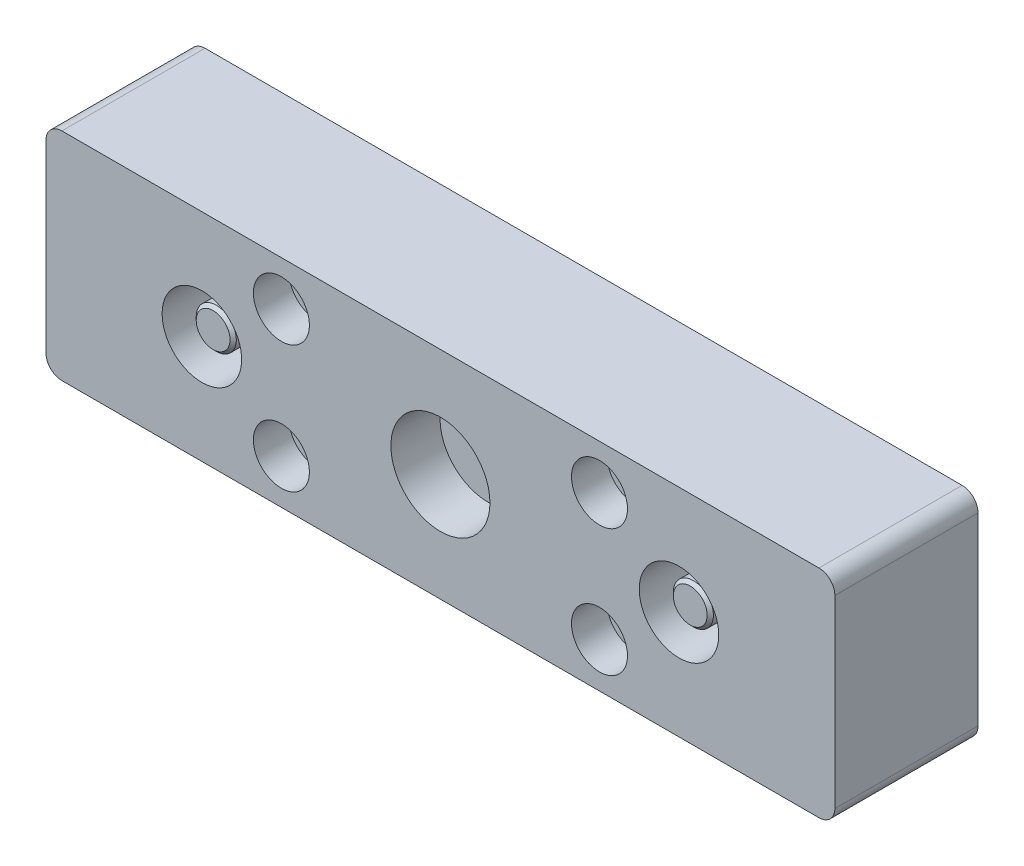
ISO-10303-21;
HEADER;
FILE_DESCRIPTION(('STEP AP214'),'2;1');
FILE_NAME('part.step','',(''),(''),'','','');
FILE_SCHEMA(('AUTOMOTIVE_DESIGN { 1 0 10303 214 1 1 1 1 }'));
ENDSEC;
DATA;
#1=APPLICATION_CONTEXT('core data for automotive mechanical design processes');
#2=APPLICATION_PROTOCOL_DEFINITION('international standard','automotive_design',2000,#1);
#3=PRODUCT_CONTEXT('',#1,'mechanical');
#4=PRODUCT('Part','Part','',(#3));
#5=PRODUCT_RELATED_PRODUCT_CATEGORY('part','',(#4));
#6=PRODUCT_DEFINITION_FORMATION('','',#4);
#7=PRODUCT_DEFINITION_CONTEXT('part definition',#1,'design');
#8=PRODUCT_DEFINITION('design','',#6,#7);
#9=PRODUCT_DEFINITION_SHAPE('','',#8);
#10=(LENGTH_UNIT() NAMED_UNIT(*) SI_UNIT(.MILLI.,.METRE.));
#11=(NAMED_UNIT(*) PLANE_ANGLE_UNIT() SI_UNIT($,.RADIAN.));
#12=(NAMED_UNIT(*) SI_UNIT($,.STERADIAN.) SOLID_ANGLE_UNIT());
#13=UNCERTAINTY_MEASURE_WITH_UNIT(LENGTH_MEASURE(1.E-05),#10,'distance_accuracy_value','');
#14=(GEOMETRIC_REPRESENTATION_CONTEXT(3) GLOBAL_UNCERTAINTY_ASSIGNED_CONTEXT((#13)) GLOBAL_UNIT_ASSIGNED_CONTEXT((#10,
#11,#12)) REPRESENTATION_CONTEXT('',''));
#15=CARTESIAN_POINT('',(0.,0.,0.));
#16=DIRECTION('',(0.,0.,1.));
#17=DIRECTION('',(1.,0.,0.));
#18=AXIS2_PLACEMENT_3D('',#15,#16,#17);
#19=CARTESIAN_POINT('',(47.625,24.965,26.327));
#20=DIRECTION('',(0.,0.,1.));
#21=DIRECTION('',(1.,0.,0.));
#22=AXIS2_PLACEMENT_3D('',#19,#20,#21);
#23=PLANE('',#22);
#24=CARTESIAN_POINT('',(47.625,21.59,26.327));
#25=DIRECTION('',(0.,0.,-1.));
#26=DIRECTION('',(-1.,0.,0.));
#27=AXIS2_PLACEMENT_3D('',#24,#25,#26);
#28=CIRCLE('',#27,3.375);
#29=CARTESIAN_POINT('',(44.25,21.59,26.327));
#30=VERTEX_POINT('',#29);
#31=EDGE_CURVE('E497',#30,#30,#28,.T.);
#32=ORIENTED_EDGE('',*,*,#31,.F.);
#33=EDGE_LOOP('',(#32));
#34=FACE_BOUND('',#33,.T.);
#35=ADVANCED_FACE('F14',(#34),#23,.T.);
#36=CARTESIAN_POINT('',(47.625,21.59,26.327));
#37=DIRECTION('',(0.,0.,-1.));
#38=DIRECTION('',(-1.,0.,0.));
#39=AXIS2_PLACEMENT_3D('',#36,#37,#38);
#40=CONICAL_SURFACE('',#39,3.375,0.785398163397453);
#41=CARTESIAN_POINT('',(47.625,21.59,25.702));
#42=DIRECTION('',(0.,0.,-1.));
#43=DIRECTION('',(-1.,0.,0.));
#44=AXIS2_PLACEMENT_3D('',#41,#42,#43);
#45=CIRCLE('',#44,4.);
#46=CARTESIAN_POINT('',(43.625,21.59,25.702));
#47=VERTEX_POINT('',#46);
#48=EDGE_CURVE('E494',#47,#47,#45,.T.);
#49=ORIENTED_EDGE('',*,*,#48,.F.);
#50=EDGE_LOOP('',(#49));
#51=FACE_BOUND('',#50,.T.);
#52=ORIENTED_EDGE('',*,*,#31,.T.);
#53=EDGE_LOOP('',(#52));
#54=FACE_BOUND('',#53,.T.);
#55=ADVANCED_FACE('F351',(#51,#54),#40,.T.);
#56=CARTESIAN_POINT('',(47.625,21.59,1.32700000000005));
#57=DIRECTION('',(0.,0.,-1.));
#58=DIRECTION('',(-1.,0.,0.));
#59=AXIS2_PLACEMENT_3D('',#56,#57,#58);
#60=CYLINDRICAL_SURFACE('',#59,4.);
#61=CARTESIAN_POINT('',(47.625,21.59,12.7));
#62=DIRECTION('',(0.,0.,1.));
#63=DIRECTION('',(1.,0.,0.));
#64=AXIS2_PLACEMENT_3D('',#61,#62,#63);
#65=CIRCLE('',#64,4.);
#66=CARTESIAN_POINT('',(51.625,21.59,12.7));
#67=VERTEX_POINT('',#66);
#68=EDGE_CURVE('E9',#67,#67,#65,.F.);
#69=ORIENTED_EDGE('',*,*,#68,.F.);
#70=EDGE_LOOP('',(#69));
#71=FACE_BOUND('',#70,.T.);
#72=ORIENTED_EDGE('',*,*,#48,.T.);
#73=EDGE_LOOP('',(#72));
#74=FACE_BOUND('',#73,.T.);
#75=ADVANCED_FACE('F355',(#71,#74),#60,.T.);
#76=CARTESIAN_POINT('',(-47.625,21.59,6.0452));
#77=DIRECTION('',(0.,0.,1.));
#78=DIRECTION('',(1.,0.,0.));
#79=AXIS2_PLACEMENT_3D('',#76,#77,#78);
#80=PLANE('',#79);
#81=CARTESIAN_POINT('',(-47.625,21.59,6.0452));
#82=DIRECTION('',(0.,0.,1.));
#83=DIRECTION('',(1.,0.,0.));
#84=AXIS2_PLACEMENT_3D('',#81,#82,#83);
#85=CIRCLE('',#84,0.148290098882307);
#86=CARTESIAN_POINT('',(-47.7732900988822,21.59,6.0452));
#87=VERTEX_POINT('',#86);
#88=EDGE_CURVE('E423',#87,#87,#85,.F.);
#89=ORIENTED_EDGE('',*,*,#88,.T.);
#90=EDGE_LOOP('',(#89));
#91=FACE_BOUND('',#90,.T.);
#92=ADVANCED_FACE('F318',(#91),#80,.F.);
#93=CARTESIAN_POINT('',(-47.625,21.59,4.756));
#94=DIRECTION('',(0.,0.,-1.));
#95=DIRECTION('',(-1.,0.,0.));
#96=AXIS2_PLACEMENT_3D('',#93,#94,#95);
#97=CONICAL_SURFACE('',#96,2.38125,1.0471975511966);
#98=CARTESIAN_POINT('',(-47.625,21.59,4.756));
#99=DIRECTION('',(0.,0.,-1.));
#100=DIRECTION('',(-1.,0.,0.));
#101=AXIS2_PLACEMENT_3D('',#98,#99,#100);
#102=CIRCLE('',#101,2.38125);
#103=CARTESIAN_POINT('',(-50.00625,21.59,4.756));
#104=VERTEX_POINT('',#103);
#105=EDGE_CURVE('E439',#104,#104,#102,.F.);
#106=CARTESIAN_POINT('',(-50.00625,21.59,4.756));
#107=CARTESIAN_POINT('',(-49.98299000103,21.59,4.76942916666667));
#108=CARTESIAN_POINT('',(-49.95973000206,21.59,4.78285833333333));
#109=CARTESIAN_POINT('',(-49.9132100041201,21.59,4.80971666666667));
#110=CARTESIAN_POINT('',(-49.8899500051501,21.59,4.82314583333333));
#111=CARTESIAN_POINT('',(-49.8434300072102,21.59,4.85000416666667));
#112=CARTESIAN_POINT('',(-49.8201700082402,21.59,4.86343333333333));
#113=CARTESIAN_POINT('',(-49.7736500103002,21.59,4.89029166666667));
#114=CARTESIAN_POINT('',(-49.7503900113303,21.59,4.90372083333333));
#115=CARTESIAN_POINT('',(-49.7038700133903,21.59,4.93057916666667));
#116=CARTESIAN_POINT('',(-49.6806100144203,21.59,4.94400833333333));
#117=CARTESIAN_POINT('',(-49.6340900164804,21.59,4.97086666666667));
#118=CARTESIAN_POINT('',(-49.6108300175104,21.59,4.98429583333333));
#119=CARTESIAN_POINT('',(-49.5643100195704,21.59,5.01115416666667));
#120=CARTESIAN_POINT('',(-49.5410500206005,21.59,5.02458333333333));
#121=CARTESIAN_POINT('',(-49.4945300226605,21.59,5.05144166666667));
#122=CARTESIAN_POINT('',(-49.4712700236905,21.59,5.06487083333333));
#123=CARTESIAN_POINT('',(-49.4247500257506,21.59,5.09172916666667));
#124=CARTESIAN_POINT('',(-49.4014900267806,21.59,5.10515833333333));
#125=CARTESIAN_POINT('',(-49.3549700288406,21.59,5.13201666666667));
#126=CARTESIAN_POINT('',(-49.3317100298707,21.59,5.14544583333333));
#127=CARTESIAN_POINT('',(-49.2851900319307,21.59,5.17230416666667));
#128=CARTESIAN_POINT('',(-49.2619300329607,21.59,5.18573333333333));
#129=CARTESIAN_POINT('',(-49.2154100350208,21.59,5.21259166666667));
#130=CARTESIAN_POINT('',(-49.1921500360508,21.59,5.22602083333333));
#131=CARTESIAN_POINT('',(-49.1456300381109,21.59,5.25287916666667));
#132=CARTESIAN_POINT('',(-49.1223700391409,21.59,5.26630833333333));
#133=CARTESIAN_POINT('',(-49.0758500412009,21.59,5.29316666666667));
#134=CARTESIAN_POINT('',(-49.0525900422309,21.59,5.30659583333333));
#135=CARTESIAN_POINT('',(-49.006070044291,21.59,5.33345416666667));
#136=CARTESIAN_POINT('',(-48.982810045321,21.59,5.34688333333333));
#137=CARTESIAN_POINT('',(-48.9362900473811,21.59,5.37374166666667));
#138=CARTESIAN_POINT('',(-48.9130300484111,21.59,5.38717083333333));
#139=CARTESIAN_POINT('',(-48.8665100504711,21.59,5.41402916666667));
#140=CARTESIAN_POINT('',(-48.8432500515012,21.59,5.42745833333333));
#141=CARTESIAN_POINT('',(-48.7967300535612,21.59,5.45431666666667));
#142=CARTESIAN_POINT('',(-48.7734700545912,21.59,5.46774583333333));
#143=CARTESIAN_POINT('',(-48.7269500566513,21.59,5.49460416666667));
#144=CARTESIAN_POINT('',(-48.7036900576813,21.59,5.50803333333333));
#145=CARTESIAN_POINT('',(-48.6571700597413,21.59,5.53489166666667));
#146=CARTESIAN_POINT('',(-48.6339100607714,21.59,5.54832083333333));
#147=CARTESIAN_POINT('',(-48.5873900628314,21.59,5.57517916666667));
#148=CARTESIAN_POINT('',(-48.5641300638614,21.59,5.58860833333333));
#149=CARTESIAN_POINT('',(-48.5176100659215,21.59,5.61546666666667));
#150=CARTESIAN_POINT('',(-48.4943500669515,21.59,5.62889583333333));
#151=CARTESIAN_POINT('',(-48.4478300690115,21.59,5.65575416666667));
#152=CARTESIAN_POINT('',(-48.4245700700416,21.59,5.66918333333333));
#153=CARTESIAN_POINT('',(-48.3780500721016,21.59,5.69604166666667));
#154=CARTESIAN_POINT('',(-48.3547900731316,21.59,5.70947083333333));
#155=CARTESIAN_POINT('',(-48.3082700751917,21.59,5.73632916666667));
#156=CARTESIAN_POINT('',(-48.2850100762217,21.59,5.74975833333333));
#157=CARTESIAN_POINT('',(-48.2384900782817,21.59,5.77661666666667));
#158=CARTESIAN_POINT('',(-48.2152300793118,21.59,5.79004583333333));
#159=CARTESIAN_POINT('',(-48.1687100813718,21.59,5.81690416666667));
#160=CARTESIAN_POINT('',(-48.1454500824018,21.59,5.83033333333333));
#161=CARTESIAN_POINT('',(-48.0989300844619,21.59,5.85719166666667));
#162=CARTESIAN_POINT('',(-48.0756700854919,21.59,5.87062083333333));
#163=CARTESIAN_POINT('',(-48.029150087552,21.59,5.89747916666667));
#164=CARTESIAN_POINT('',(-48.005890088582,21.59,5.91090833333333));
#165=CARTESIAN_POINT('',(-47.959370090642,21.59,5.93776666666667));
#166=CARTESIAN_POINT('',(-47.936110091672,21.59,5.95119583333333));
#167=CARTESIAN_POINT('',(-47.8895900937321,21.59,5.97805416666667));
#168=CARTESIAN_POINT('',(-47.8663300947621,21.59,5.99148333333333));
#169=CARTESIAN_POINT('',(-47.8198100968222,21.59,6.01834166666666));
#170=CARTESIAN_POINT('',(-47.7965500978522,21.59,6.03177083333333));
#171=CARTESIAN_POINT('',(-47.7732900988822,21.59,6.0452));
#172=B_SPLINE_CURVE_WITH_KNOTS('',3,(#106,#107,#108,#109,#110,#111,#112,#113,#114,#115,#116,
#117,#118,#119,#120,#121,#122,#123,#124,#125,#126,#127,#128,#129,#130,#131,#132,#133,#134,#135,
#136,#137,#138,#139,#140,#141,#142,#143,#144,#145,#146,#147,#148,#149,#150,#151,#152,#153,#154,
#155,#156,#157,#158,#159,#160,#161,#162,#163,#164,#165,#166,#167,#168,#169,#170,#171),
.UNSPECIFIED.,.F.,.F.,(4,2,2,2,2,2,2,2,2,2,2,2,2,2,2,2,2,2,2,2,2,2,2,2,2,2,2,2,2,2,2,2,4),(0.,
0.0805750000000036,0.161150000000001,0.241724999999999,0.322300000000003,0.402875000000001,
0.483449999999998,0.564025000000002,0.6446,0.725174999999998,0.805750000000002,
0.886324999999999,0.966899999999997,1.047475,1.12805,1.208625,1.2892,1.369775,1.45035,1.530925,
1.6115,1.692075,1.77265,1.853225,1.9338,2.014375,2.09495,2.17552499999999,2.2561,2.336675,
2.41724999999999,2.497825,2.5784),.UNSPECIFIED.);
#173=EDGE_CURVE('BSEAM394',#104,#87,#172,.T.);
#174=ORIENTED_EDGE('',*,*,#105,.F.);
#175=ORIENTED_EDGE('',*,*,#88,.F.);
#176=ORIENTED_EDGE('',*,*,#173,.T.);
#177=ORIENTED_EDGE('',*,*,#173,.F.);
#178=EDGE_LOOP('',(#174,#176,#175,#177));
#179=FACE_BOUND('',#178,.T.);
#180=ADVANCED_FACE('F394',(#179),#97,.F.);
#181=CARTESIAN_POINT('',(-47.625,24.965,26.327));
#182=DIRECTION('',(0.,0.,1.));
#183=DIRECTION('',(1.,0.,0.));
#184=AXIS2_PLACEMENT_3D('',#181,#182,#183);
#185=PLANE('',#184);
#186=CARTESIAN_POINT('',(-47.625,21.59,26.327));
#187=DIRECTION('',(0.,0.,-1.));
#188=DIRECTION('',(-1.,0.,0.));
#189=AXIS2_PLACEMENT_3D('',#186,#187,#188);
#190=CIRCLE('',#189,3.375);
#191=CARTESIAN_POINT('',(-51.,21.59,26.327));
#192=VERTEX_POINT('',#191);
#193=EDGE_CURVE('E436',#192,#192,#190,.T.);
#194=ORIENTED_EDGE('',*,*,#193,.F.);
#195=EDGE_LOOP('',(#194));
#196=FACE_BOUND('',#195,.T.);
#197=ADVANCED_FACE('F367',(#196),#185,.T.);
#198=CARTESIAN_POINT('',(-47.625,18.7032486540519,4.756));
#199=DIRECTION('',(0.,0.,-1.));
#200=DIRECTION('',(-1.,0.,0.));
#201=AXIS2_PLACEMENT_3D('',#198,#199,#200);
#202=PLANE('',#201);
#203=DIRECTION('',(0.866025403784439,0.5,0.));
#204=VECTOR('',#203,1.);
#205=CARTESIAN_POINT('',(-47.625,18.7032486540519,4.756));
#206=LINE('',#205,#204);
#207=CARTESIAN_POINT('',(-47.625,18.7032486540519,4.756));
#208=VERTEX_POINT('',#207);
#209=CARTESIAN_POINT('',(-45.125,20.1466243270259,4.756));
#210=VERTEX_POINT('',#209);
#211=EDGE_CURVE('E460',#208,#210,#206,.T.);
#212=ORIENTED_EDGE('',*,*,#211,.F.);
#213=DIRECTION('',(0.866025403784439,-0.5,0.));
#214=VECTOR('',#213,1.);
#215=CARTESIAN_POINT('',(-50.125,20.1466243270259,4.756));
#216=LINE('',#215,#214);
#217=CARTESIAN_POINT('',(-50.125,20.1466243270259,4.756));
#218=VERTEX_POINT('',#217);
#219=EDGE_CURVE('E456',#218,#208,#216,.T.);
#220=ORIENTED_EDGE('',*,*,#219,.F.);
#221=DIRECTION('',(0.,-1.,0.));
#222=VECTOR('',#221,1.);
#223=CARTESIAN_POINT('',(-50.125,23.033375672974,4.756));
#224=LINE('',#223,#222);
#225=CARTESIAN_POINT('',(-50.125,23.033375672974,4.756));
#226=VERTEX_POINT('',#225);
#227=EDGE_CURVE('E477',#226,#218,#224,.T.);
#228=ORIENTED_EDGE('',*,*,#227,.F.);
#229=DIRECTION('',(-0.866025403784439,-0.5,0.));
#230=VECTOR('',#229,1.);
#231=CARTESIAN_POINT('',(-47.625,24.4767513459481,4.756));
#232=LINE('',#231,#230);
#233=CARTESIAN_POINT('',(-47.625,24.4767513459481,4.756));
#234=VERTEX_POINT('',#233);
#235=EDGE_CURVE('E479',#234,#226,#232,.T.);
#236=ORIENTED_EDGE('',*,*,#235,.F.);
#237=DIRECTION('',(-0.866025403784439,0.5,0.));
#238=VECTOR('',#237,1.);
#239=CARTESIAN_POINT('',(-45.125,23.033375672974,4.756));
#240=LINE('',#239,#238);
#241=CARTESIAN_POINT('',(-45.125,23.033375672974,4.756));
#242=VERTEX_POINT('',#241);
#243=EDGE_CURVE('E481',#242,#234,#240,.T.);
#244=ORIENTED_EDGE('',*,*,#243,.F.);
#245=DIRECTION('',(0.,1.,0.));
#246=VECTOR('',#245,1.);
#247=CARTESIAN_POINT('',(-45.125,20.1466243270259,4.756));
#248=LINE('',#247,#246);
#249=EDGE_CURVE('E483',#210,#242,#248,.T.);
#250=ORIENTED_EDGE('',*,*,#249,.F.);
#251=EDGE_LOOP('',(#212,#220,#228,#236,#244,#250));
#252=FACE_BOUND('',#251,.T.);
#253=ORIENTED_EDGE('',*,*,#105,.T.);
#254=EDGE_LOOP('',(#253));
#255=FACE_BOUND('',#254,.T.);
#256=ADVANCED_FACE('F363',(#252,#255),#202,.T.);
#257=CARTESIAN_POINT('',(-47.625,21.59,26.327));
#258=DIRECTION('',(0.,0.,-1.));
#259=DIRECTION('',(-1.,0.,0.));
#260=AXIS2_PLACEMENT_3D('',#257,#258,#259);
#261=CONICAL_SURFACE('',#260,3.375,0.785398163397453);
#262=CARTESIAN_POINT('',(-47.625,21.59,25.702));
#263=DIRECTION('',(0.,0.,-1.));
#264=DIRECTION('',(-1.,0.,0.));
#265=AXIS2_PLACEMENT_3D('',#262,#263,#264);
#266=CIRCLE('',#265,4.);
#267=CARTESIAN_POINT('',(-51.625,21.59,25.702));
#268=VERTEX_POINT('',#267);
#269=EDGE_CURVE('E433',#268,#268,#266,.T.);
#270=ORIENTED_EDGE('',*,*,#269,.F.);
#271=EDGE_LOOP('',(#270));
#272=FACE_BOUND('',#271,.T.);
#273=ORIENTED_EDGE('',*,*,#193,.T.);
#274=EDGE_LOOP('',(#273));
#275=FACE_BOUND('',#274,.T.);
#276=ADVANCED_FACE('F366',(#272,#275),#261,.T.);
#277=CARTESIAN_POINT('',(-50.125,23.033375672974,4.756));
#278=DIRECTION('',(1.,0.,0.));
#279=DIRECTION('',(0.,0.,-1.));
#280=AXIS2_PLACEMENT_3D('',#277,#278,#279);
#281=PLANE('',#280);
#282=DIRECTION('',(0.,-1.,0.));
#283=VECTOR('',#282,1.);
#284=CARTESIAN_POINT('',(-50.125,23.033375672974,1.32700000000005));
#285=LINE('',#284,#283);
#286=CARTESIAN_POINT('',(-50.125,23.033375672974,1.32700000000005));
#287=VERTEX_POINT('',#286);
#288=CARTESIAN_POINT('',(-50.125,20.1466243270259,1.32700000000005));
#289=VERTEX_POINT('',#288);
#290=EDGE_CURVE('E461',#287,#289,#285,.T.);
#291=ORIENTED_EDGE('',*,*,#290,.F.);
#292=DIRECTION('',(0.,0.,-1.));
#293=VECTOR('',#292,1.);
#294=CARTESIAN_POINT('',(-50.125,23.033375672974,4.756));
#295=LINE('',#294,#293);
#296=EDGE_CURVE('E449',#226,#287,#295,.T.);
#297=ORIENTED_EDGE('',*,*,#296,.F.);
#298=ORIENTED_EDGE('',*,*,#227,.T.);
#299=DIRECTION('',(0.,0.,-1.));
#300=VECTOR('',#299,1.);
#301=CARTESIAN_POINT('',(-50.125,20.1466243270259,4.756));
#302=LINE('',#301,#300);
#303=EDGE_CURVE('E451',#218,#289,#302,.T.);
#304=ORIENTED_EDGE('',*,*,#303,.T.);
#305=EDGE_LOOP('',(#291,#297,#298,#304));
#306=FACE_BOUND('',#305,.T.);
#307=ADVANCED_FACE('F375',(#306),#281,.T.);
#308=CARTESIAN_POINT('',(-47.625,24.4767513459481,4.756));
#309=DIRECTION('',(0.5,-0.866025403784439,0.));
#310=DIRECTION('',(0.866025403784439,0.5,0.));
#311=AXIS2_PLACEMENT_3D('',#308,#309,#310);
#312=PLANE('',#311);
#313=DIRECTION('',(-0.866025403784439,-0.5,0.));
#314=VECTOR('',#313,1.);
#315=CARTESIAN_POINT('',(-47.625,24.4767513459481,1.32700000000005));
#316=LINE('',#315,#314);
#317=CARTESIAN_POINT('',(-47.625,24.4767513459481,1.32700000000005));
#318=VERTEX_POINT('',#317);
#319=EDGE_CURVE('E464',#318,#287,#316,.T.);
#320=ORIENTED_EDGE('',*,*,#319,.F.);
#321=DIRECTION('',(0.,0.,-1.));
#322=VECTOR('',#321,1.);
#323=CARTESIAN_POINT('',(-47.625,24.4767513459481,4.756));
#324=LINE('',#323,#322);
#325=EDGE_CURVE('E447',#234,#318,#324,.T.);
#326=ORIENTED_EDGE('',*,*,#325,.F.);
#327=ORIENTED_EDGE('',*,*,#235,.T.);
#328=ORIENTED_EDGE('',*,*,#296,.T.);
#329=EDGE_LOOP('',(#320,#326,#327,#328));
#330=FACE_BOUND('',#329,.T.);
#331=ADVANCED_FACE('F378',(#330),#312,.T.);
#332=CARTESIAN_POINT('',(-45.125,23.033375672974,4.756));
#333=DIRECTION('',(-0.5,-0.866025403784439,0.));
#334=DIRECTION('',(0.866025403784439,-0.5,0.));
#335=AXIS2_PLACEMENT_3D('',#332,#333,#334);
#336=PLANE('',#335);
#337=DIRECTION('',(-0.866025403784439,0.5,0.));
#338=VECTOR('',#337,1.);
#339=CARTESIAN_POINT('',(-45.125,23.033375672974,1.32700000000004));
#340=LINE('',#339,#338);
#341=CARTESIAN_POINT('',(-45.125,23.033375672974,1.32700000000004));
#342=VERTEX_POINT('',#341);
#343=EDGE_CURVE('E467',#342,#318,#340,.T.);
#344=ORIENTED_EDGE('',*,*,#343,.F.);
#345=DIRECTION('',(0.,0.,-1.));
#346=VECTOR('',#345,1.);
#347=CARTESIAN_POINT('',(-45.125,23.033375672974,4.756));
#348=LINE('',#347,#346);
#349=EDGE_CURVE('E445',#242,#342,#348,.T.);
#350=ORIENTED_EDGE('',*,*,#349,.F.);
#351=ORIENTED_EDGE('',*,*,#243,.T.);
#352=ORIENTED_EDGE('',*,*,#325,.T.);
#353=EDGE_LOOP('',(#344,#350,#351,#352));
#354=FACE_BOUND('',#353,.T.);
#355=ADVANCED_FACE('F382',(#354),#336,.T.);
#356=CARTESIAN_POINT('',(-45.125,20.1466243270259,4.756));
#357=DIRECTION('',(-1.,0.,0.));
#358=DIRECTION('',(0.,0.,1.));
#359=AXIS2_PLACEMENT_3D('',#356,#357,#358);
#360=PLANE('',#359);
#361=DIRECTION('',(0.,1.,0.));
#362=VECTOR('',#361,1.);
#363=CARTESIAN_POINT('',(-45.125,20.1466243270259,1.32700000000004));
#364=LINE('',#363,#362);
#365=CARTESIAN_POINT('',(-45.125,20.1466243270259,1.32700000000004));
#366=VERTEX_POINT('',#365);
#367=EDGE_CURVE('E470',#366,#342,#364,.T.);
#368=ORIENTED_EDGE('',*,*,#367,.F.);
#369=DIRECTION('',(0.,0.,-1.));
#370=VECTOR('',#369,1.);
#371=CARTESIAN_POINT('',(-45.125,20.1466243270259,4.756));
#372=LINE('',#371,#370);
#373=EDGE_CURVE('E442',#210,#366,#372,.T.);
#374=ORIENTED_EDGE('',*,*,#373,.F.);
#375=ORIENTED_EDGE('',*,*,#249,.T.);
#376=ORIENTED_EDGE('',*,*,#349,.T.);
#377=EDGE_LOOP('',(#368,#374,#375,#376));
#378=FACE_BOUND('',#377,.T.);
#379=ADVANCED_FACE('F386',(#378),#360,.T.);
#380=CARTESIAN_POINT('',(-47.625,18.7032486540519,4.756));
#381=DIRECTION('',(-0.5,0.866025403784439,0.));
#382=DIRECTION('',(-0.866025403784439,-0.5,0.));
#383=AXIS2_PLACEMENT_3D('',#380,#381,#382);
#384=PLANE('',#383);
#385=DIRECTION('',(0.866025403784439,0.5,0.));
#386=VECTOR('',#385,1.);
#387=CARTESIAN_POINT('',(-47.625,18.7032486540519,1.32700000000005));
#388=LINE('',#387,#386);
#389=CARTESIAN_POINT('',(-47.625,18.7032486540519,1.32700000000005));
#390=VERTEX_POINT('',#389);
#391=EDGE_CURVE('E473',#390,#366,#388,.T.);
#392=ORIENTED_EDGE('',*,*,#391,.F.);
#393=DIRECTION('',(0.,0.,-1.));
#394=VECTOR('',#393,1.);
#395=CARTESIAN_POINT('',(-47.625,18.7032486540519,4.756));
#396=LINE('',#395,#394);
#397=EDGE_CURVE('E453',#208,#390,#396,.T.);
#398=ORIENTED_EDGE('',*,*,#397,.F.);
#399=ORIENTED_EDGE('',*,*,#211,.T.);
#400=ORIENTED_EDGE('',*,*,#373,.T.);
#401=EDGE_LOOP('',(#392,#398,#399,#400));
#402=FACE_BOUND('',#401,.T.);
#403=ADVANCED_FACE('F373',(#402),#384,.T.);
#404=CARTESIAN_POINT('',(-50.125,20.1466243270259,4.756));
#405=DIRECTION('',(0.5,0.866025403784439,0.));
#406=DIRECTION('',(-0.866025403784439,0.5,0.));
#407=AXIS2_PLACEMENT_3D('',#404,#405,#406);
#408=PLANE('',#407);
#409=DIRECTION('',(0.866025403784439,-0.5,0.));
#410=VECTOR('',#409,1.);
#411=CARTESIAN_POINT('',(-50.125,20.1466243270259,1.32700000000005));
#412=LINE('',#411,#410);
#413=EDGE_CURVE('E457',#289,#390,#412,.T.);
#414=ORIENTED_EDGE('',*,*,#413,.F.);
#415=ORIENTED_EDGE('',*,*,#303,.F.);
#416=ORIENTED_EDGE('',*,*,#219,.T.);
#417=ORIENTED_EDGE('',*,*,#397,.T.);
#418=EDGE_LOOP('',(#414,#415,#416,#417));
#419=FACE_BOUND('',#418,.T.);
#420=ADVANCED_FACE('F369',(#419),#408,.T.);
#421=CARTESIAN_POINT('',(-47.625,21.59,1.32700000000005));
#422=DIRECTION('',(0.,0.,-1.));
#423=DIRECTION('',(-1.,0.,0.));
#424=AXIS2_PLACEMENT_3D('',#421,#422,#423);
#425=CYLINDRICAL_SURFACE('',#424,4.);
#426=CARTESIAN_POINT('',(-47.625,21.59,12.7));
#427=DIRECTION('',(0.,0.,1.));
#428=DIRECTION('',(1.,0.,0.));
#429=AXIS2_PLACEMENT_3D('',#426,#427,#428);
#430=CIRCLE('',#429,4.);
#431=CARTESIAN_POINT('',(-43.625,21.59,12.7));
#432=VERTEX_POINT('',#431);
#433=EDGE_CURVE('E199',#432,#432,#430,.F.);
#434=ORIENTED_EDGE('',*,*,#433,.F.);
#435=EDGE_LOOP('',(#434));
#436=FACE_BOUND('',#435,.T.);
#437=ORIENTED_EDGE('',*,*,#269,.T.);
#438=EDGE_LOOP('',(#437));
#439=FACE_BOUND('',#438,.T.);
#440=ADVANCED_FACE('F372',(#436,#439),#425,.T.);
#441=CARTESIAN_POINT('',(-47.625,21.59,1.32700000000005));
#442=DIRECTION('',(0.,0.,-1.));
#443=DIRECTION('',(-1.,0.,0.));
#444=AXIS2_PLACEMENT_3D('',#441,#442,#443);
#445=PLANE('',#444);
#446=CARTESIAN_POINT('',(-47.625,21.59,1.32700000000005));
#447=DIRECTION('',(0.,0.,-1.));
#448=DIRECTION('',(-1.,0.,0.));
#449=AXIS2_PLACEMENT_3D('',#446,#447,#448);
#450=CIRCLE('',#449,8.96);
#451=CARTESIAN_POINT('',(-56.585,21.59,1.32700000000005));
#452=VERTEX_POINT('',#451);
#453=EDGE_CURVE('E425',#452,#452,#450,.T.);
#454=ORIENTED_EDGE('',*,*,#453,.T.);
#455=EDGE_LOOP('',(#454));
#456=FACE_BOUND('',#455,.T.);
#457=ORIENTED_EDGE('',*,*,#413,.T.);
#458=ORIENTED_EDGE('',*,*,#391,.T.);
#459=ORIENTED_EDGE('',*,*,#367,.T.);
#460=ORIENTED_EDGE('',*,*,#343,.T.);
#461=ORIENTED_EDGE('',*,*,#319,.T.);
#462=ORIENTED_EDGE('',*,*,#290,.T.);
#463=EDGE_LOOP('',(#457,#458,#459,#460,#461,#462));
#464=FACE_BOUND('',#463,.T.);
#465=ADVANCED_FACE('F406',(#456,#464),#445,.T.);
#466=CARTESIAN_POINT('',(-47.625,21.59,12.7));
#467=DIRECTION('',(0.,0.,1.));
#468=DIRECTION('',(-1.,0.,0.));
#469=AXIS2_PLACEMENT_3D('',#466,#467,#468);
#470=PLANE('',#469);
#471=ORIENTED_EDGE('',*,*,#433,.T.);
#472=EDGE_LOOP('',(#471));
#473=FACE_BOUND('',#472,.T.);
#474=CARTESIAN_POINT('',(-47.625,21.59,12.7));
#475=DIRECTION('',(0.,0.,-1.));
#476=DIRECTION('',(-1.,0.,0.));
#477=AXIS2_PLACEMENT_3D('',#474,#475,#476);
#478=CIRCLE('',#477,7.9375);
#479=CARTESIAN_POINT('',(-55.5625,21.59,12.7));
#480=VERTEX_POINT('',#479);
#481=EDGE_CURVE('E223',#480,#480,#478,.T.);
#482=ORIENTED_EDGE('',*,*,#481,.F.);
#483=EDGE_LOOP('',(#482));
#484=FACE_BOUND('',#483,.T.);
#485=ADVANCED_FACE('F415',(#473,#484),#470,.T.);
#486=CARTESIAN_POINT('',(-78.74,43.18,19.05));
#487=DIRECTION('',(0.,0.,-1.));
#488=DIRECTION('',(-1.,0.,0.));
#489=AXIS2_PLACEMENT_3D('',#486,#487,#488);
#490=PLANE('',#489);
#491=CARTESIAN_POINT('',(0.,21.59,19.05));
#492=DIRECTION('',(0.,0.,-1.));
#493=DIRECTION('',(-1.,0.,0.));
#494=AXIS2_PLACEMENT_3D('',#491,#492,#493);
#495=CIRCLE('',#494,9.6008697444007);
#496=CARTESIAN_POINT('',(-9.6008697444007,21.59,19.05));
#497=VERTEX_POINT('',#496);
#498=EDGE_CURVE('E18',#497,#497,#495,.F.);
#499=ORIENTED_EDGE('',*,*,#498,.T.);
#500=EDGE_LOOP('',(#499));
#501=FACE_BOUND('',#500,.T.);
#502=ADVANCED_FACE('F412',(#501),#490,.F.);
#503=CARTESIAN_POINT('',(-47.625,21.59,1.32700000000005));
#504=DIRECTION('',(0.,0.,-1.));
#505=DIRECTION('',(-1.,0.,0.));
#506=AXIS2_PLACEMENT_3D('',#503,#504,#505);
#507=CYLINDRICAL_SURFACE('',#506,8.96);
#508=CARTESIAN_POINT('',(-47.625,21.59,1.45400000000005));
#509=DIRECTION('',(0.,0.,-1.));
#510=DIRECTION('',(-1.,0.,0.));
#511=AXIS2_PLACEMENT_3D('',#508,#509,#510);
#512=CIRCLE('',#511,8.96);
#513=CARTESIAN_POINT('',(-56.585,21.59,1.45400000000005));
#514=VERTEX_POINT('',#513);
#515=EDGE_CURVE('E428',#514,#514,#512,.T.);
#516=ORIENTED_EDGE('',*,*,#515,.T.);
#517=EDGE_LOOP('',(#516));
#518=FACE_BOUND('',#517,.T.);
#519=ORIENTED_EDGE('',*,*,#453,.F.);
#520=EDGE_LOOP('',(#519));
#521=FACE_BOUND('',#520,.T.);
#522=ADVANCED_FACE('F408',(#518,#521),#507,.T.);
#523=CARTESIAN_POINT('',(31.75,34.29,21.463));
#524=DIRECTION('',(0.,0.,1.));
#525=DIRECTION('',(1.,0.,0.));
#526=AXIS2_PLACEMENT_3D('',#523,#524,#525);
#527=PLANE('',#526);
#528=CARTESIAN_POINT('',(31.75,34.29,21.463));
#529=DIRECTION('',(0.,0.,1.));
#530=DIRECTION('',(1.,0.,0.));
#531=AXIS2_PLACEMENT_3D('',#528,#529,#530);
#532=CIRCLE('',#531,5.588);
#533=CARTESIAN_POINT('',(37.338,34.29,21.463));
#534=VERTEX_POINT('',#533);
#535=EDGE_CURVE('E172',#534,#534,#532,.T.);
#536=ORIENTED_EDGE('',*,*,#535,.T.);
#537=EDGE_LOOP('',(#536));
#538=FACE_BOUND('',#537,.T.);
#539=CARTESIAN_POINT('',(31.75,34.29,21.463));
#540=DIRECTION('',(0.,0.,1.));
#541=DIRECTION('',(1.,0.,0.));
#542=AXIS2_PLACEMENT_3D('',#539,#540,#541);
#543=CIRCLE('',#542,3.2639);
#544=CARTESIAN_POINT('',(35.0139,34.29,21.463));
#545=VERTEX_POINT('',#544);
#546=EDGE_CURVE('E168',#545,#545,#543,.F.);
#547=ORIENTED_EDGE('',*,*,#546,.T.);
#548=EDGE_LOOP('',(#547));
#549=FACE_BOUND('',#548,.T.);
#550=ADVANCED_FACE('F411',(#538,#549),#527,.T.);
#551=CARTESIAN_POINT('',(31.75,8.89,21.463));
#552=DIRECTION('',(0.,0.,1.));
#553=DIRECTION('',(1.,0.,0.));
#554=AXIS2_PLACEMENT_3D('',#551,#552,#553);
#555=PLANE('',#554);
#556=CARTESIAN_POINT('',(31.75,8.89,21.463));
#557=DIRECTION('',(0.,0.,-1.));
#558=DIRECTION('',(1.,0.,0.));
#559=AXIS2_PLACEMENT_3D('',#556,#557,#558);
#560=CIRCLE('',#559,5.588);
#561=CARTESIAN_POINT('',(37.338,8.89,21.463));
#562=VERTEX_POINT('',#561);
#563=EDGE_CURVE('E177',#562,#562,#560,.T.);
#564=ORIENTED_EDGE('',*,*,#563,.F.);
#565=EDGE_LOOP('',(#564));
#566=FACE_BOUND('',#565,.T.);
#567=CARTESIAN_POINT('',(31.75,8.89,21.463));
#568=DIRECTION('',(0.,0.,1.));
#569=DIRECTION('',(1.,0.,0.));
#570=AXIS2_PLACEMENT_3D('',#567,#568,#569);
#571=CIRCLE('',#570,3.2639);
#572=CARTESIAN_POINT('',(35.0139,8.89,21.463));
#573=VERTEX_POINT('',#572);
#574=EDGE_CURVE('E173',#573,#573,#571,.F.);
#575=ORIENTED_EDGE('',*,*,#574,.T.);
#576=EDGE_LOOP('',(#575));
#577=FACE_BOUND('',#576,.T.);
#578=ADVANCED_FACE('F930',(#566,#577),#555,.T.);
#579=CARTESIAN_POINT('',(-31.75,8.89,21.463));
#580=DIRECTION('',(0.,0.,1.));
#581=DIRECTION('',(-1.,0.,0.));
#582=AXIS2_PLACEMENT_3D('',#579,#580,#581);
#583=PLANE('',#582);
#584=CARTESIAN_POINT('',(-31.75,8.89,21.463));
#585=DIRECTION('',(0.,0.,1.));
#586=DIRECTION('',(-1.,0.,0.));
#587=AXIS2_PLACEMENT_3D('',#584,#585,#586);
#588=CIRCLE('',#587,5.588);
#589=CARTESIAN_POINT('',(-37.338,8.89,21.463));
#590=VERTEX_POINT('',#589);
#591=EDGE_CURVE('E181',#590,#590,#588,.T.);
#592=ORIENTED_EDGE('',*,*,#591,.T.);
#593=EDGE_LOOP('',(#592));
#594=FACE_BOUND('',#593,.T.);
#595=CARTESIAN_POINT('',(-31.75,8.89,21.463));
#596=DIRECTION('',(0.,0.,1.));
#597=DIRECTION('',(1.,0.,0.));
#598=AXIS2_PLACEMENT_3D('',#595,#596,#597);
#599=CIRCLE('',#598,3.2639);
#600=CARTESIAN_POINT('',(-28.4861,8.89,21.463));
#601=VERTEX_POINT('',#600);
#602=EDGE_CURVE('E178',#601,#601,#599,.F.);
#603=ORIENTED_EDGE('',*,*,#602,.T.);
#604=EDGE_LOOP('',(#603));
#605=FACE_BOUND('',#604,.T.);
#606=ADVANCED_FACE('F934',(#594,#605),#583,.T.);
#607=CARTESIAN_POINT('',(-31.75,34.29,21.463));
#608=DIRECTION('',(0.,0.,1.));
#609=DIRECTION('',(-1.,0.,0.));
#610=AXIS2_PLACEMENT_3D('',#607,#608,#609);
#611=PLANE('',#610);
#612=CARTESIAN_POINT('',(-31.75,34.29,21.463));
#613=DIRECTION('',(0.,0.,-1.));
#614=DIRECTION('',(-1.,0.,0.));
#615=AXIS2_PLACEMENT_3D('',#612,#613,#614);
#616=CIRCLE('',#615,5.588);
#617=CARTESIAN_POINT('',(-37.338,34.29,21.463));
#618=VERTEX_POINT('',#617);
#619=EDGE_CURVE('E185',#618,#618,#616,.T.);
#620=ORIENTED_EDGE('',*,*,#619,.F.);
#621=EDGE_LOOP('',(#620));
#622=FACE_BOUND('',#621,.T.);
#623=CARTESIAN_POINT('',(-31.75,34.29,21.463));
#624=DIRECTION('',(0.,0.,1.));
#625=DIRECTION('',(1.,0.,0.));
#626=AXIS2_PLACEMENT_3D('',#623,#624,#625);
#627=CIRCLE('',#626,3.2639);
#628=CARTESIAN_POINT('',(-28.4861,34.29,21.463));
#629=VERTEX_POINT('',#628);
#630=EDGE_CURVE('E182',#629,#629,#627,.F.);
#631=ORIENTED_EDGE('',*,*,#630,.T.);
#632=EDGE_LOOP('',(#631));
#633=FACE_BOUND('',#632,.T.);
#634=ADVANCED_FACE('F938',(#622,#633),#611,.T.);
#635=CARTESIAN_POINT('',(-31.75,34.29,21.463));
#636=DIRECTION('',(0.,0.,1.));
#637=DIRECTION('',(1.,0.,0.));
#638=AXIS2_PLACEMENT_3D('',#635,#636,#637);
#639=CYLINDRICAL_SURFACE('',#638,5.588);
#640=ORIENTED_EDGE('',*,*,#619,.T.);
#641=EDGE_LOOP('',(#640));
#642=FACE_BOUND('',#641,.T.);
#643=CARTESIAN_POINT('',(-31.75,34.29,28.575));
#644=DIRECTION('',(0.,0.,-1.));
#645=DIRECTION('',(-1.,0.,0.));
#646=AXIS2_PLACEMENT_3D('',#643,#644,#645);
#647=CIRCLE('',#646,5.588);
#648=CARTESIAN_POINT('',(-37.338,34.29,28.575));
#649=VERTEX_POINT('',#648);
#650=EDGE_CURVE('E192',#649,#649,#647,.T.);
#651=ORIENTED_EDGE('',*,*,#650,.F.);
#652=EDGE_LOOP('',(#651));
#653=FACE_BOUND('',#652,.T.);
#654=ADVANCED_FACE('F921',(#642,#653),#639,.F.);
#655=CARTESIAN_POINT('',(-31.75,8.89,21.463));
#656=DIRECTION('',(0.,0.,1.));
#657=DIRECTION('',(1.,0.,0.));
#658=AXIS2_PLACEMENT_3D('',#655,#656,#657);
#659=CYLINDRICAL_SURFACE('',#658,5.588);
#660=ORIENTED_EDGE('',*,*,#591,.F.);
#661=EDGE_LOOP('',(#660));
#662=FACE_BOUND('',#661,.T.);
#663=CARTESIAN_POINT('',(-31.75,8.89,28.575));
#664=DIRECTION('',(0.,0.,1.));
#665=DIRECTION('',(-1.,0.,0.));
#666=AXIS2_PLACEMENT_3D('',#663,#664,#665);
#667=CIRCLE('',#666,5.588);
#668=CARTESIAN_POINT('',(-37.338,8.89,28.575));
#669=VERTEX_POINT('',#668);
#670=EDGE_CURVE('E189',#669,#669,#667,.T.);
#671=ORIENTED_EDGE('',*,*,#670,.T.);
#672=EDGE_LOOP('',(#671));
#673=FACE_BOUND('',#672,.T.);
#674=ADVANCED_FACE('F915',(#662,#673),#659,.F.);
#675=CARTESIAN_POINT('',(-47.625,21.59,12.7));
#676=DIRECTION('',(0.,0.,1.));
#677=DIRECTION('',(1.,0.,0.));
#678=AXIS2_PLACEMENT_3D('',#675,#676,#677);
#679=CYLINDRICAL_SURFACE('',#678,7.9375);
#680=ORIENTED_EDGE('',*,*,#481,.T.);
#681=EDGE_LOOP('',(#680));
#682=FACE_BOUND('',#681,.T.);
#683=CARTESIAN_POINT('',(-47.625,21.59,28.575));
#684=DIRECTION('',(0.,0.,-1.));
#685=DIRECTION('',(-1.,0.,0.));
#686=AXIS2_PLACEMENT_3D('',#683,#684,#685);
#687=CIRCLE('',#686,7.9375);
#688=CARTESIAN_POINT('',(-55.5625,21.59,28.575));
#689=VERTEX_POINT('',#688);
#690=EDGE_CURVE('E222',#689,#689,#687,.T.);
#691=ORIENTED_EDGE('',*,*,#690,.F.);
#692=EDGE_LOOP('',(#691));
#693=FACE_BOUND('',#692,.T.);
#694=ADVANCED_FACE('F912',(#682,#693),#679,.F.);
#695=CARTESIAN_POINT('',(75.565,3.175,28.575));
#696=DIRECTION('',(0.,0.,-1.));
#697=DIRECTION('',(-1.,0.,0.));
#698=AXIS2_PLACEMENT_3D('',#695,#696,#697);
#699=CYLINDRICAL_SURFACE('',#698,3.175);
#700=CARTESIAN_POINT('',(75.565,3.175,28.575));
#701=DIRECTION('',(0.,0.,-1.));
#702=DIRECTION('',(-1.,0.,0.));
#703=AXIS2_PLACEMENT_3D('',#700,#701,#702);
#704=CIRCLE('',#703,3.175);
#705=CARTESIAN_POINT('',(75.565,0.,28.575));
#706=VERTEX_POINT('',#705);
#707=CARTESIAN_POINT('',(78.74,3.175,28.575));
#708=VERTEX_POINT('',#707);
#709=EDGE_CURVE('E157',#706,#708,#704,.F.);
#710=ORIENTED_EDGE('',*,*,#709,.F.);
#711=DIRECTION('',(0.,0.,-1.));
#712=VECTOR('',#711,1.);
#713=CARTESIAN_POINT('',(75.565,0.,28.575));
#714=LINE('',#713,#712);
#715=CARTESIAN_POINT('',(75.565,0.,0.));
#716=VERTEX_POINT('',#715);
#717=EDGE_CURVE('E149',#716,#706,#714,.F.);
#718=ORIENTED_EDGE('',*,*,#717,.F.);
#719=CARTESIAN_POINT('',(75.565,3.175,0.));
#720=DIRECTION('',(0.,0.,-1.));
#721=DIRECTION('',(-1.,0.,0.));
#722=AXIS2_PLACEMENT_3D('',#719,#720,#721);
#723=CIRCLE('',#722,3.175);
#724=CARTESIAN_POINT('',(78.74,3.175,0.));
#725=VERTEX_POINT('',#724);
#726=EDGE_CURVE('E265',#725,#716,#723,.T.);
#727=ORIENTED_EDGE('',*,*,#726,.F.);
#728=DIRECTION('',(0.,0.,-1.));
#729=VECTOR('',#728,1.);
#730=CARTESIAN_POINT('',(78.74,3.175,28.575));
#731=LINE('',#730,#729);
#732=EDGE_CURVE('E165',#708,#725,#731,.T.);
#733=ORIENTED_EDGE('',*,*,#732,.F.);
#734=EDGE_LOOP('',(#710,#718,#727,#733));
#735=FACE_BOUND('',#734,.T.);
#736=ADVANCED_FACE('F292',(#735),#699,.T.);
#737=CARTESIAN_POINT('',(78.74,0.,28.575));
#738=DIRECTION('',(-1.,0.,0.));
#739=DIRECTION('',(0.,0.,1.));
#740=AXIS2_PLACEMENT_3D('',#737,#738,#739);
#741=PLANE('',#740);
#742=DIRECTION('',(0.,1.,0.));
#743=VECTOR('',#742,1.);
#744=CARTESIAN_POINT('',(78.74,0.,28.575));
#745=LINE('',#744,#743);
#746=CARTESIAN_POINT('',(78.74,40.005,28.575));
#747=VERTEX_POINT('',#746);
#748=EDGE_CURVE('E150',#708,#747,#745,.T.);
#749=ORIENTED_EDGE('',*,*,#748,.F.);
#750=ORIENTED_EDGE('',*,*,#732,.T.);
#751=DIRECTION('',(0.,1.,0.));
#752=VECTOR('',#751,1.);
#753=CARTESIAN_POINT('',(78.74,0.,0.));
#754=LINE('',#753,#752);
#755=CARTESIAN_POINT('',(78.74,40.005,0.));
#756=VERTEX_POINT('',#755);
#757=EDGE_CURVE('E255',#725,#756,#754,.T.);
#758=ORIENTED_EDGE('',*,*,#757,.T.);
#759=DIRECTION('',(0.,0.,-1.));
#760=VECTOR('',#759,1.);
#761=CARTESIAN_POINT('',(78.74,40.005,28.575));
#762=LINE('',#761,#760);
#763=EDGE_CURVE('E141',#756,#747,#762,.F.);
#764=ORIENTED_EDGE('',*,*,#763,.T.);
#765=EDGE_LOOP('',(#749,#750,#758,#764));
#766=FACE_BOUND('',#765,.T.);
#767=ADVANCED_FACE('F295',(#766),#741,.F.);
#768=CARTESIAN_POINT('',(75.565,40.005,28.575));
#769=DIRECTION('',(0.,0.,-1.));
#770=DIRECTION('',(-1.,0.,0.));
#771=AXIS2_PLACEMENT_3D('',#768,#769,#770);
#772=CYLINDRICAL_SURFACE('',#771,3.175);
#773=CARTESIAN_POINT('',(75.565,40.005,28.575));
#774=DIRECTION('',(0.,0.,-1.));
#775=DIRECTION('',(-1.,0.,0.));
#776=AXIS2_PLACEMENT_3D('',#773,#774,#775);
#777=CIRCLE('',#776,3.175);
#778=CARTESIAN_POINT('',(75.565,43.18,28.575));
#779=VERTEX_POINT('',#778);
#780=EDGE_CURVE('E126',#747,#779,#777,.F.);
#781=ORIENTED_EDGE('',*,*,#780,.F.);
#782=ORIENTED_EDGE('',*,*,#763,.F.);
#783=CARTESIAN_POINT('',(75.565,40.005,0.));
#784=DIRECTION('',(0.,0.,-1.));
#785=DIRECTION('',(-1.,0.,0.));
#786=AXIS2_PLACEMENT_3D('',#783,#784,#785);
#787=CIRCLE('',#786,3.175);
#788=CARTESIAN_POINT('',(75.565,43.18,0.));
#789=VERTEX_POINT('',#788);
#790=EDGE_CURVE('E263',#789,#756,#787,.T.);
#791=ORIENTED_EDGE('',*,*,#790,.F.);
#792=DIRECTION('',(0.,0.,-1.));
#793=VECTOR('',#792,1.);
#794=CARTESIAN_POINT('',(75.565,43.18,28.575));
#795=LINE('',#794,#793);
#796=EDGE_CURVE('E142',#779,#789,#795,.T.);
#797=ORIENTED_EDGE('',*,*,#796,.F.);
#798=EDGE_LOOP('',(#781,#782,#791,#797));
#799=FACE_BOUND('',#798,.T.);
#800=ADVANCED_FACE('F16',(#799),#772,.T.);
#801=CARTESIAN_POINT('',(-78.74,43.18,28.575));
#802=DIRECTION('',(0.,-1.,0.));
#803=DIRECTION('',(0.,0.,-1.));
#804=AXIS2_PLACEMENT_3D('',#801,#802,#803);
#805=PLANE('',#804);
#806=DIRECTION('',(-1.,0.,0.));
#807=VECTOR('',#806,1.);
#808=CARTESIAN_POINT('',(-78.74,43.18,0.));
#809=LINE('',#808,#807);
#810=CARTESIAN_POINT('',(-75.565,43.18,0.));
#811=VERTEX_POINT('',#810);
#812=EDGE_CURVE('E138',#789,#811,#809,.T.);
#813=ORIENTED_EDGE('',*,*,#812,.T.);
#814=DIRECTION('',(0.,0.,-1.));
#815=VECTOR('',#814,1.);
#816=CARTESIAN_POINT('',(-75.565,43.18,28.575));
#817=LINE('',#816,#815);
#818=CARTESIAN_POINT('',(-75.565,43.18,28.575));
#819=VERTEX_POINT('',#818);
#820=EDGE_CURVE('E132',#811,#819,#817,.F.);
#821=ORIENTED_EDGE('',*,*,#820,.T.);
#822=DIRECTION('',(-1.,0.,0.));
#823=VECTOR('',#822,1.);
#824=CARTESIAN_POINT('',(-78.74,43.18,28.575));
#825=LINE('',#824,#823);
#826=EDGE_CURVE('E135',#779,#819,#825,.T.);
#827=ORIENTED_EDGE('',*,*,#826,.F.);
#828=ORIENTED_EDGE('',*,*,#796,.T.);
#829=EDGE_LOOP('',(#813,#821,#827,#828));
#830=FACE_BOUND('',#829,.T.);
#831=ADVANCED_FACE('F133',(#830),#805,.F.);
#832=CARTESIAN_POINT('',(-75.565,40.005,28.575));
#833=DIRECTION('',(0.,0.,-1.));
#834=DIRECTION('',(-1.,0.,0.));
#835=AXIS2_PLACEMENT_3D('',#832,#833,#834);
#836=CYLINDRICAL_SURFACE('',#835,3.175);
#837=CARTESIAN_POINT('',(-75.565,40.005,28.575));
#838=DIRECTION('',(0.,0.,-1.));
#839=DIRECTION('',(-1.,0.,0.));
#840=AXIS2_PLACEMENT_3D('',#837,#838,#839);
#841=CIRCLE('',#840,3.175);
#842=CARTESIAN_POINT('',(-78.74,40.005,28.575));
#843=VERTEX_POINT('',#842);
#844=EDGE_CURVE('E147',#819,#843,#841,.F.);
#845=ORIENTED_EDGE('',*,*,#844,.F.);
#846=ORIENTED_EDGE('',*,*,#820,.F.);
#847=CARTESIAN_POINT('',(-75.565,40.005,0.));
#848=DIRECTION('',(0.,0.,-1.));
#849=DIRECTION('',(-1.,0.,0.));
#850=AXIS2_PLACEMENT_3D('',#847,#848,#849);
#851=CIRCLE('',#850,3.175);
#852=CARTESIAN_POINT('',(-78.74,40.005,0.));
#853=VERTEX_POINT('',#852);
#854=EDGE_CURVE('E267',#853,#811,#851,.T.);
#855=ORIENTED_EDGE('',*,*,#854,.F.);
#856=DIRECTION('',(0.,0.,-1.));
#857=VECTOR('',#856,1.);
#858=CARTESIAN_POINT('',(-78.74,40.005,28.575));
#859=LINE('',#858,#857);
#860=EDGE_CURVE('E155',#843,#853,#859,.T.);
#861=ORIENTED_EDGE('',*,*,#860,.F.);
#862=EDGE_LOOP('',(#845,#846,#855,#861));
#863=FACE_BOUND('',#862,.T.);
#864=ADVANCED_FACE('F153',(#863),#836,.T.);
#865=CARTESIAN_POINT('',(-78.74,0.,28.575));
#866=DIRECTION('',(1.,0.,0.));
#867=DIRECTION('',(0.,0.,-1.));
#868=AXIS2_PLACEMENT_3D('',#865,#866,#867);
#869=PLANE('',#868);
#870=DIRECTION('',(0.,-1.,0.));
#871=VECTOR('',#870,1.);
#872=CARTESIAN_POINT('',(-78.74,0.,0.));
#873=LINE('',#872,#871);
#874=CARTESIAN_POINT('',(-78.74,3.175,0.));
#875=VERTEX_POINT('',#874);
#876=EDGE_CURVE('E243',#853,#875,#873,.T.);
#877=ORIENTED_EDGE('',*,*,#876,.T.);
#878=DIRECTION('',(0.,0.,-1.));
#879=VECTOR('',#878,1.);
#880=CARTESIAN_POINT('',(-78.74,3.175,28.575));
#881=LINE('',#880,#879);
#882=CARTESIAN_POINT('',(-78.74,3.175,28.575));
#883=VERTEX_POINT('',#882);
#884=EDGE_CURVE('E272',#875,#883,#881,.F.);
#885=ORIENTED_EDGE('',*,*,#884,.T.);
#886=DIRECTION('',(0.,-1.,0.));
#887=VECTOR('',#886,1.);
#888=CARTESIAN_POINT('',(-78.74,0.,28.575));
#889=LINE('',#888,#887);
#890=EDGE_CURVE('E244',#843,#883,#889,.T.);
#891=ORIENTED_EDGE('',*,*,#890,.F.);
#892=ORIENTED_EDGE('',*,*,#860,.T.);
#893=EDGE_LOOP('',(#877,#885,#891,#892));
#894=FACE_BOUND('',#893,.T.);
#895=ADVANCED_FACE('F275',(#894),#869,.F.);
#896=CARTESIAN_POINT('',(-75.565,3.175,28.575));
#897=DIRECTION('',(0.,0.,-1.));
#898=DIRECTION('',(-1.,0.,0.));
#899=AXIS2_PLACEMENT_3D('',#896,#897,#898);
#900=CYLINDRICAL_SURFACE('',#899,3.175);
#901=CARTESIAN_POINT('',(-75.565,3.175,28.575));
#902=DIRECTION('',(0.,0.,-1.));
#903=DIRECTION('',(-1.,0.,0.));
#904=AXIS2_PLACEMENT_3D('',#901,#902,#903);
#905=CIRCLE('',#904,3.175);
#906=CARTESIAN_POINT('',(-75.565,0.,28.575));
#907=VERTEX_POINT('',#906);
#908=EDGE_CURVE('E156',#883,#907,#905,.F.);
#909=ORIENTED_EDGE('',*,*,#908,.F.);
#910=ORIENTED_EDGE('',*,*,#884,.F.);
#911=CARTESIAN_POINT('',(-75.565,3.175,0.));
#912=DIRECTION('',(0.,0.,-1.));
#913=DIRECTION('',(-1.,0.,0.));
#914=AXIS2_PLACEMENT_3D('',#911,#912,#913);
#915=CIRCLE('',#914,3.175);
#916=CARTESIAN_POINT('',(-75.565,0.,0.));
#917=VERTEX_POINT('',#916);
#918=EDGE_CURVE('E269',#917,#875,#915,.T.);
#919=ORIENTED_EDGE('',*,*,#918,.F.);
#920=DIRECTION('',(0.,0.,-1.));
#921=VECTOR('',#920,1.);
#922=CARTESIAN_POINT('',(-75.565,0.,28.575));
#923=LINE('',#922,#921);
#924=EDGE_CURVE('E260',#907,#917,#923,.T.);
#925=ORIENTED_EDGE('',*,*,#924,.F.);
#926=EDGE_LOOP('',(#909,#910,#919,#925));
#927=FACE_BOUND('',#926,.T.);
#928=ADVANCED_FACE('F281',(#927),#900,.T.);
#929=CARTESIAN_POINT('',(-78.74,0.,28.575));
#930=DIRECTION('',(0.,1.,0.));
#931=DIRECTION('',(0.,0.,1.));
#932=AXIS2_PLACEMENT_3D('',#929,#930,#931);
#933=PLANE('',#932);
#934=DIRECTION('',(1.,0.,0.));
#935=VECTOR('',#934,1.);
#936=CARTESIAN_POINT('',(-78.74,0.,28.575));
#937=LINE('',#936,#935);
#938=EDGE_CURVE('E246',#907,#706,#937,.T.);
#939=ORIENTED_EDGE('',*,*,#938,.F.);
#940=ORIENTED_EDGE('',*,*,#924,.T.);
#941=DIRECTION('',(1.,0.,0.));
#942=VECTOR('',#941,1.);
#943=CARTESIAN_POINT('',(-78.74,0.,0.));
#944=LINE('',#943,#942);
#945=EDGE_CURVE('E252',#917,#716,#944,.T.);
#946=ORIENTED_EDGE('',*,*,#945,.T.);
#947=ORIENTED_EDGE('',*,*,#717,.T.);
#948=EDGE_LOOP('',(#939,#940,#946,#947));
#949=FACE_BOUND('',#948,.T.);
#950=ADVANCED_FACE('F284',(#949),#933,.F.);
#951=CARTESIAN_POINT('',(-47.625,21.59,0.));
#952=DIRECTION('',(0.,0.,-1.));
#953=DIRECTION('',(-1.,0.,0.));
#954=AXIS2_PLACEMENT_3D('',#951,#952,#953);
#955=CONICAL_SURFACE('',#954,10.414,0.785398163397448);
#956=ORIENTED_EDGE('',*,*,#515,.F.);
#957=EDGE_LOOP('',(#956));
#958=FACE_BOUND('',#957,.T.);
#959=CARTESIAN_POINT('',(-47.625,21.59,0.));
#960=DIRECTION('',(0.,0.,-1.));
#961=DIRECTION('',(-1.,0.,0.));
#962=AXIS2_PLACEMENT_3D('',#959,#960,#961);
#963=CIRCLE('',#962,10.414);
#964=CARTESIAN_POINT('',(-58.039,21.59,0.));
#965=VERTEX_POINT('',#964);
#966=EDGE_CURVE('E226',#965,#965,#963,.T.);
#967=ORIENTED_EDGE('',*,*,#966,.T.);
#968=EDGE_LOOP('',(#967));
#969=FACE_BOUND('',#968,.T.);
#970=ADVANCED_FACE('F729',(#958,#969),#955,.F.);
#971=CARTESIAN_POINT('',(31.75,34.29,0.));
#972=DIRECTION('',(0.,0.,-1.));
#973=DIRECTION('',(-1.,0.,0.));
#974=AXIS2_PLACEMENT_3D('',#971,#972,#973);
#975=CYLINDRICAL_SURFACE('',#974,3.2639);
#976=CARTESIAN_POINT('',(31.75,34.29,0.));
#977=DIRECTION('',(0.,0.,-1.));
#978=DIRECTION('',(-1.,0.,0.));
#979=AXIS2_PLACEMENT_3D('',#976,#977,#978);
#980=CIRCLE('',#979,3.2639);
#981=CARTESIAN_POINT('',(28.4861,34.29,0.));
#982=VERTEX_POINT('',#981);
#983=EDGE_CURVE('E171',#982,#982,#980,.T.);
#984=ORIENTED_EDGE('',*,*,#983,.T.);
#985=EDGE_LOOP('',(#984));
#986=FACE_BOUND('',#985,.T.);
#987=ORIENTED_EDGE('',*,*,#546,.F.);
#988=EDGE_LOOP('',(#987));
#989=FACE_BOUND('',#988,.T.);
#990=ADVANCED_FACE('F739',(#986,#989),#975,.F.);
#991=CARTESIAN_POINT('',(31.75,8.89,0.));
#992=DIRECTION('',(0.,0.,-1.));
#993=DIRECTION('',(-1.,0.,0.));
#994=AXIS2_PLACEMENT_3D('',#991,#992,#993);
#995=CYLINDRICAL_SURFACE('',#994,3.2639);
#996=CARTESIAN_POINT('',(31.75,8.89,0.));
#997=DIRECTION('',(0.,0.,-1.));
#998=DIRECTION('',(-1.,0.,0.));
#999=AXIS2_PLACEMENT_3D('',#996,#997,#998);
#1000=CIRCLE('',#999,3.2639);
#1001=CARTESIAN_POINT('',(28.4861,8.89,0.));
#1002=VERTEX_POINT('',#1001);
#1003=EDGE_CURVE('E176',#1002,#1002,#1000,.T.);
#1004=ORIENTED_EDGE('',*,*,#1003,.T.);
#1005=EDGE_LOOP('',(#1004));
#1006=FACE_BOUND('',#1005,.T.);
#1007=ORIENTED_EDGE('',*,*,#574,.F.);
#1008=EDGE_LOOP('',(#1007));
#1009=FACE_BOUND('',#1008,.T.);
#1010=ADVANCED_FACE('F750',(#1006,#1009),#995,.F.);
#1011=CARTESIAN_POINT('',(-31.75,8.89,0.));
#1012=DIRECTION('',(0.,0.,-1.));
#1013=DIRECTION('',(-1.,0.,0.));
#1014=AXIS2_PLACEMENT_3D('',#1011,#1012,#1013);
#1015=CYLINDRICAL_SURFACE('',#1014,3.2639);
#1016=CARTESIAN_POINT('',(-31.75,8.89,0.));
#1017=DIRECTION('',(0.,0.,-1.));
#1018=DIRECTION('',(-1.,0.,0.));
#1019=AXIS2_PLACEMENT_3D('',#1016,#1017,#1018);
#1020=CIRCLE('',#1019,3.2639);
#1021=CARTESIAN_POINT('',(-35.0139,8.89,0.));
#1022=VERTEX_POINT('',#1021);
#1023=EDGE_CURVE('E180',#1022,#1022,#1020,.T.);
#1024=ORIENTED_EDGE('',*,*,#1023,.T.);
#1025=EDGE_LOOP('',(#1024));
#1026=FACE_BOUND('',#1025,.T.);
#1027=ORIENTED_EDGE('',*,*,#602,.F.);
#1028=EDGE_LOOP('',(#1027));
#1029=FACE_BOUND('',#1028,.T.);
#1030=ADVANCED_FACE('F761',(#1026,#1029),#1015,.F.);
#1031=CARTESIAN_POINT('',(-31.75,34.29,0.));
#1032=DIRECTION('',(0.,0.,-1.));
#1033=DIRECTION('',(-1.,0.,0.));
#1034=AXIS2_PLACEMENT_3D('',#1031,#1032,#1033);
#1035=CYLINDRICAL_SURFACE('',#1034,3.2639);
#1036=CARTESIAN_POINT('',(-31.75,34.29,0.));
#1037=DIRECTION('',(0.,0.,-1.));
#1038=DIRECTION('',(-1.,0.,0.));
#1039=AXIS2_PLACEMENT_3D('',#1036,#1037,#1038);
#1040=CIRCLE('',#1039,3.2639);
#1041=CARTESIAN_POINT('',(-35.0139,34.29,0.));
#1042=VERTEX_POINT('',#1041);
#1043=EDGE_CURVE('E184',#1042,#1042,#1040,.T.);
#1044=ORIENTED_EDGE('',*,*,#1043,.T.);
#1045=EDGE_LOOP('',(#1044));
#1046=FACE_BOUND('',#1045,.T.);
#1047=ORIENTED_EDGE('',*,*,#630,.F.);
#1048=EDGE_LOOP('',(#1047));
#1049=FACE_BOUND('',#1048,.T.);
#1050=ADVANCED_FACE('F772',(#1046,#1049),#1035,.F.);
#1051=CARTESIAN_POINT('',(-78.74,43.18,0.));
#1052=DIRECTION('',(0.,0.,-1.));
#1053=DIRECTION('',(-1.,0.,0.));
#1054=AXIS2_PLACEMENT_3D('',#1051,#1052,#1053);
#1055=PLANE('',#1054);
#1056=ORIENTED_EDGE('',*,*,#1043,.F.);
#1057=EDGE_LOOP('',(#1056));
#1058=FACE_BOUND('',#1057,.T.);
#1059=ORIENTED_EDGE('',*,*,#1023,.F.);
#1060=EDGE_LOOP('',(#1059));
#1061=FACE_BOUND('',#1060,.T.);
#1062=ORIENTED_EDGE('',*,*,#1003,.F.);
#1063=EDGE_LOOP('',(#1062));
#1064=FACE_BOUND('',#1063,.T.);
#1065=ORIENTED_EDGE('',*,*,#983,.F.);
#1066=EDGE_LOOP('',(#1065));
#1067=FACE_BOUND('',#1066,.T.);
#1068=ORIENTED_EDGE('',*,*,#966,.F.);
#1069=EDGE_LOOP('',(#1068));
#1070=FACE_BOUND('',#1069,.T.);
#1071=CARTESIAN_POINT('',(47.625,21.59,0.));
#1072=DIRECTION('',(0.,0.,-1.));
#1073=DIRECTION('',(-1.,0.,0.));
#1074=AXIS2_PLACEMENT_3D('',#1071,#1072,#1073);
#1075=CIRCLE('',#1074,10.414);
#1076=CARTESIAN_POINT('',(37.211,21.59,0.));
#1077=VERTEX_POINT('',#1076);
#1078=EDGE_CURVE('E235',#1077,#1077,#1075,.T.);
#1079=ORIENTED_EDGE('',*,*,#1078,.F.);
#1080=EDGE_LOOP('',(#1079));
#1081=FACE_BOUND('',#1080,.T.);
#1082=ORIENTED_EDGE('',*,*,#945,.F.);
#1083=ORIENTED_EDGE('',*,*,#918,.T.);
#1084=ORIENTED_EDGE('',*,*,#876,.F.);
#1085=ORIENTED_EDGE('',*,*,#854,.T.);
#1086=ORIENTED_EDGE('',*,*,#812,.F.);
#1087=ORIENTED_EDGE('',*,*,#790,.T.);
#1088=ORIENTED_EDGE('',*,*,#757,.F.);
#1089=ORIENTED_EDGE('',*,*,#726,.T.);
#1090=EDGE_LOOP('',(#1082,#1083,#1084,#1085,#1086,#1087,#1088,#1089));
#1091=FACE_BOUND('',#1090,.T.);
#1092=ADVANCED_FACE('F287',(#1058,#1061,#1064,#1067,#1070,#1081,#1091),#1055,.T.);
#1093=CARTESIAN_POINT('',(47.625,21.59,0.));
#1094=DIRECTION('',(0.,0.,-1.));
#1095=DIRECTION('',(-1.,0.,0.));
#1096=AXIS2_PLACEMENT_3D('',#1093,#1094,#1095);
#1097=CONICAL_SURFACE('',#1096,10.414,0.785398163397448);
#1098=CARTESIAN_POINT('',(47.625,21.59,1.45400000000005));
#1099=DIRECTION('',(0.,0.,-1.));
#1100=DIRECTION('',(-1.,0.,0.));
#1101=AXIS2_PLACEMENT_3D('',#1098,#1099,#1100);
#1102=CIRCLE('',#1101,8.96);
#1103=CARTESIAN_POINT('',(38.665,21.59,1.45400000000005));
#1104=VERTEX_POINT('',#1103);
#1105=EDGE_CURVE('E491',#1104,#1104,#1102,.T.);
#1106=ORIENTED_EDGE('',*,*,#1105,.F.);
#1107=EDGE_LOOP('',(#1106));
#1108=FACE_BOUND('',#1107,.T.);
#1109=ORIENTED_EDGE('',*,*,#1078,.T.);
#1110=EDGE_LOOP('',(#1109));
#1111=FACE_BOUND('',#1110,.T.);
#1112=ADVANCED_FACE('F793',(#1108,#1111),#1097,.F.);
#1113=CARTESIAN_POINT('',(0.,21.59,28.575));
#1114=DIRECTION('',(0.,0.,1.));
#1115=DIRECTION('',(1.,0.,0.));
#1116=AXIS2_PLACEMENT_3D('',#1113,#1114,#1115);
#1117=CONICAL_SURFACE('',#1116,9.886061,0.0299323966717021);
#1118=CARTESIAN_POINT('',(0.,21.59,28.575));
#1119=DIRECTION('',(0.,0.,1.));
#1120=DIRECTION('',(1.,0.,0.));
#1121=AXIS2_PLACEMENT_3D('',#1118,#1119,#1120);
#1122=CIRCLE('',#1121,9.886061);
#1123=CARTESIAN_POINT('',(9.886061,21.59,28.575));
#1124=VERTEX_POINT('',#1123);
#1125=EDGE_CURVE('E240',#1124,#1124,#1122,.T.);
#1126=ORIENTED_EDGE('',*,*,#1125,.T.);
#1127=EDGE_LOOP('',(#1126));
#1128=FACE_BOUND('',#1127,.T.);
#1129=ORIENTED_EDGE('',*,*,#498,.F.);
#1130=EDGE_LOOP('',(#1129));
#1131=FACE_BOUND('',#1130,.T.);
#1132=ADVANCED_FACE('F804',(#1128,#1131),#1117,.F.);
#1133=CARTESIAN_POINT('',(31.75,34.29,21.463));
#1134=DIRECTION('',(0.,0.,1.));
#1135=DIRECTION('',(1.,0.,0.));
#1136=AXIS2_PLACEMENT_3D('',#1133,#1134,#1135);
#1137=CYLINDRICAL_SURFACE('',#1136,5.588);
#1138=ORIENTED_EDGE('',*,*,#535,.F.);
#1139=EDGE_LOOP('',(#1138));
#1140=FACE_BOUND('',#1139,.T.);
#1141=CARTESIAN_POINT('',(31.75,34.29,28.575));
#1142=DIRECTION('',(0.,0.,1.));
#1143=DIRECTION('',(1.,0.,0.));
#1144=AXIS2_PLACEMENT_3D('',#1141,#1142,#1143);
#1145=CIRCLE('',#1144,5.588);
#1146=CARTESIAN_POINT('',(37.338,34.29,28.575));
#1147=VERTEX_POINT('',#1146);
#1148=EDGE_CURVE('E215',#1147,#1147,#1145,.T.);
#1149=ORIENTED_EDGE('',*,*,#1148,.T.);
#1150=EDGE_LOOP('',(#1149));
#1151=FACE_BOUND('',#1150,.T.);
#1152=ADVANCED_FACE('F815',(#1140,#1151),#1137,.F.);
#1153=CARTESIAN_POINT('',(31.75,8.89,21.463));
#1154=DIRECTION('',(0.,0.,1.));
#1155=DIRECTION('',(1.,0.,0.));
#1156=AXIS2_PLACEMENT_3D('',#1153,#1154,#1155);
#1157=CYLINDRICAL_SURFACE('',#1156,5.588);
#1158=ORIENTED_EDGE('',*,*,#563,.T.);
#1159=EDGE_LOOP('',(#1158));
#1160=FACE_BOUND('',#1159,.T.);
#1161=CARTESIAN_POINT('',(31.75,8.89,28.575));
#1162=DIRECTION('',(0.,0.,-1.));
#1163=DIRECTION('',(1.,0.,0.));
#1164=AXIS2_PLACEMENT_3D('',#1161,#1162,#1163);
#1165=CIRCLE('',#1164,5.588);
#1166=CARTESIAN_POINT('',(37.338,8.89,28.575));
#1167=VERTEX_POINT('',#1166);
#1168=EDGE_CURVE('E208',#1167,#1167,#1165,.T.);
#1169=ORIENTED_EDGE('',*,*,#1168,.F.);
#1170=EDGE_LOOP('',(#1169));
#1171=FACE_BOUND('',#1170,.T.);
#1172=ADVANCED_FACE('F826',(#1160,#1171),#1157,.F.);
#1173=CARTESIAN_POINT('',(-78.74,43.18,28.575));
#1174=DIRECTION('',(0.,0.,-1.));
#1175=DIRECTION('',(-1.,0.,0.));
#1176=AXIS2_PLACEMENT_3D('',#1173,#1174,#1175);
#1177=PLANE('',#1176);
#1178=ORIENTED_EDGE('',*,*,#1168,.T.);
#1179=EDGE_LOOP('',(#1178));
#1180=FACE_BOUND('',#1179,.T.);
#1181=ORIENTED_EDGE('',*,*,#1148,.F.);
#1182=EDGE_LOOP('',(#1181));
#1183=FACE_BOUND('',#1182,.T.);
#1184=CARTESIAN_POINT('',(47.625,21.59,28.575));
#1185=DIRECTION('',(0.,0.,1.));
#1186=DIRECTION('',(1.,0.,0.));
#1187=AXIS2_PLACEMENT_3D('',#1184,#1185,#1186);
#1188=CIRCLE('',#1187,7.9375);
#1189=CARTESIAN_POINT('',(55.5625,21.59,28.575));
#1190=VERTEX_POINT('',#1189);
#1191=EDGE_CURVE('E231',#1190,#1190,#1188,.T.);
#1192=ORIENTED_EDGE('',*,*,#1191,.F.);
#1193=EDGE_LOOP('',(#1192));
#1194=FACE_BOUND('',#1193,.T.);
#1195=ORIENTED_EDGE('',*,*,#1125,.F.);
#1196=EDGE_LOOP('',(#1195));
#1197=FACE_BOUND('',#1196,.T.);
#1198=ORIENTED_EDGE('',*,*,#890,.T.);
#1199=ORIENTED_EDGE('',*,*,#908,.T.);
#1200=ORIENTED_EDGE('',*,*,#938,.T.);
#1201=ORIENTED_EDGE('',*,*,#709,.T.);
#1202=ORIENTED_EDGE('',*,*,#748,.T.);
#1203=ORIENTED_EDGE('',*,*,#780,.T.);
#1204=ORIENTED_EDGE('',*,*,#826,.T.);
#1205=ORIENTED_EDGE('',*,*,#844,.T.);
#1206=EDGE_LOOP('',(#1198,#1199,#1200,#1201,#1202,#1203,#1204,#1205));
#1207=FACE_BOUND('',#1206,.T.);
#1208=ORIENTED_EDGE('',*,*,#690,.T.);
#1209=EDGE_LOOP('',(#1208));
#1210=FACE_BOUND('',#1209,.T.);
#1211=ORIENTED_EDGE('',*,*,#670,.F.);
#1212=EDGE_LOOP('',(#1211));
#1213=FACE_BOUND('',#1212,.T.);
#1214=ORIENTED_EDGE('',*,*,#650,.T.);
#1215=EDGE_LOOP('',(#1214));
#1216=FACE_BOUND('',#1215,.T.);
#1217=ADVANCED_FACE('F145',(#1180,#1183,#1194,#1197,#1207,#1210,#1213,#1216),#1177,.F.);
#1218=CARTESIAN_POINT('',(47.625,21.59,12.7));
#1219=DIRECTION('',(0.,0.,1.));
#1220=DIRECTION('',(1.,0.,0.));
#1221=AXIS2_PLACEMENT_3D('',#1218,#1219,#1220);
#1222=CYLINDRICAL_SURFACE('',#1221,7.9375);
#1223=CARTESIAN_POINT('',(47.625,21.59,12.7));
#1224=DIRECTION('',(0.,0.,1.));
#1225=DIRECTION('',(1.,0.,0.));
#1226=AXIS2_PLACEMENT_3D('',#1223,#1224,#1225);
#1227=CIRCLE('',#1226,7.9375);
#1228=CARTESIAN_POINT('',(55.5625,21.59,12.7));
#1229=VERTEX_POINT('',#1228);
#1230=EDGE_CURVE('E232',#1229,#1229,#1227,.T.);
#1231=ORIENTED_EDGE('',*,*,#1230,.F.);
#1232=EDGE_LOOP('',(#1231));
#1233=FACE_BOUND('',#1232,.T.);
#1234=ORIENTED_EDGE('',*,*,#1191,.T.);
#1235=EDGE_LOOP('',(#1234));
#1236=FACE_BOUND('',#1235,.T.);
#1237=ADVANCED_FACE('F334',(#1233,#1236),#1222,.F.);
#1238=CARTESIAN_POINT('',(47.625,21.59,12.7));
#1239=DIRECTION('',(0.,0.,1.));
#1240=DIRECTION('',(1.,0.,0.));
#1241=AXIS2_PLACEMENT_3D('',#1238,#1239,#1240);
#1242=PLANE('',#1241);
#1243=ORIENTED_EDGE('',*,*,#68,.T.);
#1244=EDGE_LOOP('',(#1243));
#1245=FACE_BOUND('',#1244,.T.);
#1246=ORIENTED_EDGE('',*,*,#1230,.T.);
#1247=EDGE_LOOP('',(#1246));
#1248=FACE_BOUND('',#1247,.T.);
#1249=ADVANCED_FACE('F324',(#1245,#1248),#1242,.T.);
#1250=CARTESIAN_POINT('',(50.125,20.1466243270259,4.756));
#1251=DIRECTION('',(-1.,0.,0.));
#1252=DIRECTION('',(0.,0.,1.));
#1253=AXIS2_PLACEMENT_3D('',#1250,#1251,#1252);
#1254=PLANE('',#1253);
#1255=DIRECTION('',(0.,1.,0.));
#1256=VECTOR('',#1255,1.);
#1257=CARTESIAN_POINT('',(50.125,20.1466243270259,1.32700000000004));
#1258=LINE('',#1257,#1256);
#1259=CARTESIAN_POINT('',(50.125,20.1466243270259,1.32700000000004));
#1260=VERTEX_POINT('',#1259);
#1261=CARTESIAN_POINT('',(50.125,23.033375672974,1.32700000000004));
#1262=VERTEX_POINT('',#1261);
#1263=EDGE_CURVE('E533',#1260,#1262,#1258,.T.);
#1264=ORIENTED_EDGE('',*,*,#1263,.F.);
#1265=DIRECTION('',(0.,0.,-1.));
#1266=VECTOR('',#1265,1.);
#1267=CARTESIAN_POINT('',(50.125,20.1466243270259,4.756));
#1268=LINE('',#1267,#1266);
#1269=CARTESIAN_POINT('',(50.125,20.1466243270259,4.756));
#1270=VERTEX_POINT('',#1269);
#1271=EDGE_CURVE('E503',#1270,#1260,#1268,.T.);
#1272=ORIENTED_EDGE('',*,*,#1271,.F.);
#1273=DIRECTION('',(0.,1.,0.));
#1274=VECTOR('',#1273,1.);
#1275=CARTESIAN_POINT('',(50.125,20.1466243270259,4.756));
#1276=LINE('',#1275,#1274);
#1277=CARTESIAN_POINT('',(50.125,23.033375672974,4.756));
#1278=VERTEX_POINT('',#1277);
#1279=EDGE_CURVE('E547',#1270,#1278,#1276,.T.);
#1280=ORIENTED_EDGE('',*,*,#1279,.T.);
#1281=DIRECTION('',(0.,0.,-1.));
#1282=VECTOR('',#1281,1.);
#1283=CARTESIAN_POINT('',(50.125,23.033375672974,4.756));
#1284=LINE('',#1283,#1282);
#1285=EDGE_CURVE('E505',#1278,#1262,#1284,.T.);
#1286=ORIENTED_EDGE('',*,*,#1285,.T.);
#1287=EDGE_LOOP('',(#1264,#1272,#1280,#1286));
#1288=FACE_BOUND('',#1287,.T.);
#1289=ADVANCED_FACE('F311',(#1288),#1254,.T.);
#1290=CARTESIAN_POINT('',(50.125,23.033375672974,4.756));
#1291=DIRECTION('',(-0.5,-0.866025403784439,0.));
#1292=DIRECTION('',(0.866025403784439,-0.5,0.));
#1293=AXIS2_PLACEMENT_3D('',#1290,#1291,#1292);
#1294=PLANE('',#1293);
#1295=DIRECTION('',(-0.866025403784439,0.5,0.));
#1296=VECTOR('',#1295,1.);
#1297=CARTESIAN_POINT('',(50.125,23.033375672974,1.32700000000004));
#1298=LINE('',#1297,#1296);
#1299=CARTESIAN_POINT('',(47.625,24.4767513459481,1.32700000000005));
#1300=VERTEX_POINT('',#1299);
#1301=EDGE_CURVE('E530',#1262,#1300,#1298,.T.);
#1302=ORIENTED_EDGE('',*,*,#1301,.F.);
#1303=ORIENTED_EDGE('',*,*,#1285,.F.);
#1304=DIRECTION('',(-0.866025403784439,0.5,0.));
#1305=VECTOR('',#1304,1.);
#1306=CARTESIAN_POINT('',(50.125,23.033375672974,4.756));
#1307=LINE('',#1306,#1305);
#1308=CARTESIAN_POINT('',(47.625,24.4767513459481,4.756));
#1309=VERTEX_POINT('',#1308);
#1310=EDGE_CURVE('E544',#1278,#1309,#1307,.T.);
#1311=ORIENTED_EDGE('',*,*,#1310,.T.);
#1312=DIRECTION('',(0.,0.,-1.));
#1313=VECTOR('',#1312,1.);
#1314=CARTESIAN_POINT('',(47.625,24.4767513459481,4.756));
#1315=LINE('',#1314,#1313);
#1316=EDGE_CURVE('E508',#1309,#1300,#1315,.T.);
#1317=ORIENTED_EDGE('',*,*,#1316,.T.);
#1318=EDGE_LOOP('',(#1302,#1303,#1311,#1317));
#1319=FACE_BOUND('',#1318,.T.);
#1320=ADVANCED_FACE('F323',(#1319),#1294,.T.);
#1321=CARTESIAN_POINT('',(47.625,24.4767513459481,4.756));
#1322=DIRECTION('',(0.5,-0.866025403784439,0.));
#1323=DIRECTION('',(0.866025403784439,0.5,0.));
#1324=AXIS2_PLACEMENT_3D('',#1321,#1322,#1323);
#1325=PLANE('',#1324);
#1326=DIRECTION('',(-0.866025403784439,-0.5,0.));
#1327=VECTOR('',#1326,1.);
#1328=CARTESIAN_POINT('',(47.625,24.4767513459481,1.32700000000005));
#1329=LINE('',#1328,#1327);
#1330=CARTESIAN_POINT('',(45.125,23.033375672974,1.32700000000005));
#1331=VERTEX_POINT('',#1330);
#1332=EDGE_CURVE('E527',#1300,#1331,#1329,.T.);
#1333=ORIENTED_EDGE('',*,*,#1332,.F.);
#1334=ORIENTED_EDGE('',*,*,#1316,.F.);
#1335=DIRECTION('',(-0.866025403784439,-0.5,0.));
#1336=VECTOR('',#1335,1.);
#1337=CARTESIAN_POINT('',(47.625,24.4767513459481,4.756));
#1338=LINE('',#1337,#1336);
#1339=CARTESIAN_POINT('',(45.125,23.033375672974,4.756));
#1340=VERTEX_POINT('',#1339);
#1341=EDGE_CURVE('E541',#1309,#1340,#1338,.T.);
#1342=ORIENTED_EDGE('',*,*,#1341,.T.);
#1343=DIRECTION('',(0.,0.,-1.));
#1344=VECTOR('',#1343,1.);
#1345=CARTESIAN_POINT('',(45.125,23.033375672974,4.756));
#1346=LINE('',#1345,#1344);
#1347=EDGE_CURVE('E511',#1340,#1331,#1346,.T.);
#1348=ORIENTED_EDGE('',*,*,#1347,.T.);
#1349=EDGE_LOOP('',(#1333,#1334,#1342,#1348));
#1350=FACE_BOUND('',#1349,.T.);
#1351=ADVANCED_FACE('F331',(#1350),#1325,.T.);
#1352=CARTESIAN_POINT('',(45.125,23.033375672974,4.756));
#1353=DIRECTION('',(1.,0.,0.));
#1354=DIRECTION('',(0.,0.,-1.));
#1355=AXIS2_PLACEMENT_3D('',#1352,#1353,#1354);
#1356=PLANE('',#1355);
#1357=DIRECTION('',(0.,-1.,0.));
#1358=VECTOR('',#1357,1.);
#1359=CARTESIAN_POINT('',(45.125,23.033375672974,1.32700000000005));
#1360=LINE('',#1359,#1358);
#1361=CARTESIAN_POINT('',(45.125,20.1466243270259,1.32700000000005));
#1362=VERTEX_POINT('',#1361);
#1363=EDGE_CURVE('E524',#1331,#1362,#1360,.T.);
#1364=ORIENTED_EDGE('',*,*,#1363,.F.);
#1365=ORIENTED_EDGE('',*,*,#1347,.F.);
#1366=DIRECTION('',(0.,-1.,0.));
#1367=VECTOR('',#1366,1.);
#1368=CARTESIAN_POINT('',(45.125,23.033375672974,4.756));
#1369=LINE('',#1368,#1367);
#1370=CARTESIAN_POINT('',(45.125,20.1466243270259,4.756));
#1371=VERTEX_POINT('',#1370);
#1372=EDGE_CURVE('E538',#1340,#1371,#1369,.T.);
#1373=ORIENTED_EDGE('',*,*,#1372,.T.);
#1374=DIRECTION('',(0.,0.,-1.));
#1375=VECTOR('',#1374,1.);
#1376=CARTESIAN_POINT('',(45.125,20.1466243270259,4.756));
#1377=LINE('',#1376,#1375);
#1378=EDGE_CURVE('E514',#1371,#1362,#1377,.T.);
#1379=ORIENTED_EDGE('',*,*,#1378,.T.);
#1380=EDGE_LOOP('',(#1364,#1365,#1373,#1379));
#1381=FACE_BOUND('',#1380,.T.);
#1382=ADVANCED_FACE('F575',(#1381),#1356,.T.);
#1383=CARTESIAN_POINT('',(45.125,20.1466243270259,4.756));
#1384=DIRECTION('',(0.5,0.866025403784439,0.));
#1385=DIRECTION('',(-0.866025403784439,0.5,0.));
#1386=AXIS2_PLACEMENT_3D('',#1383,#1384,#1385);
#1387=PLANE('',#1386);
#1388=DIRECTION('',(0.866025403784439,-0.5,0.));
#1389=VECTOR('',#1388,1.);
#1390=CARTESIAN_POINT('',(45.125,20.1466243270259,1.32700000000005));
#1391=LINE('',#1390,#1389);
#1392=CARTESIAN_POINT('',(47.625,18.7032486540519,1.32700000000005));
#1393=VERTEX_POINT('',#1392);
#1394=EDGE_CURVE('E520',#1362,#1393,#1391,.T.);
#1395=ORIENTED_EDGE('',*,*,#1394,.F.);
#1396=ORIENTED_EDGE('',*,*,#1378,.F.);
#1397=DIRECTION('',(0.866025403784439,-0.5,0.));
#1398=VECTOR('',#1397,1.);
#1399=CARTESIAN_POINT('',(45.125,20.1466243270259,4.756));
#1400=LINE('',#1399,#1398);
#1401=CARTESIAN_POINT('',(47.625,18.7032486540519,4.756));
#1402=VERTEX_POINT('',#1401);
#1403=EDGE_CURVE('E519',#1371,#1402,#1400,.T.);
#1404=ORIENTED_EDGE('',*,*,#1403,.T.);
#1405=DIRECTION('',(0.,0.,-1.));
#1406=VECTOR('',#1405,1.);
#1407=CARTESIAN_POINT('',(47.625,18.7032486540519,4.756));
#1408=LINE('',#1407,#1406);
#1409=EDGE_CURVE('E517',#1402,#1393,#1408,.T.);
#1410=ORIENTED_EDGE('',*,*,#1409,.T.);
#1411=EDGE_LOOP('',(#1395,#1396,#1404,#1410));
#1412=FACE_BOUND('',#1411,.T.);
#1413=ADVANCED_FACE('F344',(#1412),#1387,.T.);
#1414=CARTESIAN_POINT('',(47.625,18.7032486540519,4.756));
#1415=DIRECTION('',(-0.5,0.866025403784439,0.));
#1416=DIRECTION('',(-0.866025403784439,-0.5,0.));
#1417=AXIS2_PLACEMENT_3D('',#1414,#1415,#1416);
#1418=PLANE('',#1417);
#1419=DIRECTION('',(0.866025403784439,0.5,0.));
#1420=VECTOR('',#1419,1.);
#1421=CARTESIAN_POINT('',(47.625,18.7032486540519,1.32700000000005));
#1422=LINE('',#1421,#1420);
#1423=EDGE_CURVE('E33',#1393,#1260,#1422,.T.);
#1424=ORIENTED_EDGE('',*,*,#1423,.F.);
#1425=ORIENTED_EDGE('',*,*,#1409,.F.);
#1426=DIRECTION('',(0.866025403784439,0.5,0.));
#1427=VECTOR('',#1426,1.);
#1428=CARTESIAN_POINT('',(47.625,18.7032486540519,4.756));
#1429=LINE('',#1428,#1427);
#1430=EDGE_CURVE('E523',#1402,#1270,#1429,.T.);
#1431=ORIENTED_EDGE('',*,*,#1430,.T.);
#1432=ORIENTED_EDGE('',*,*,#1271,.T.);
#1433=EDGE_LOOP('',(#1424,#1425,#1431,#1432));
#1434=FACE_BOUND('',#1433,.T.);
#1435=ADVANCED_FACE('F340',(#1434),#1418,.T.);
#1436=CARTESIAN_POINT('',(47.625,18.7032486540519,4.756));
#1437=DIRECTION('',(0.,0.,-1.));
#1438=DIRECTION('',(-1.,0.,0.));
#1439=AXIS2_PLACEMENT_3D('',#1436,#1437,#1438);
#1440=PLANE('',#1439);
#1441=ORIENTED_EDGE('',*,*,#1430,.F.);
#1442=ORIENTED_EDGE('',*,*,#1403,.F.);
#1443=ORIENTED_EDGE('',*,*,#1372,.F.);
#1444=ORIENTED_EDGE('',*,*,#1341,.F.);
#1445=ORIENTED_EDGE('',*,*,#1310,.F.);
#1446=ORIENTED_EDGE('',*,*,#1279,.F.);
#1447=EDGE_LOOP('',(#1441,#1442,#1443,#1444,#1445,#1446));
#1448=FACE_BOUND('',#1447,.T.);
#1449=CARTESIAN_POINT('',(47.625,21.59,4.756));
#1450=DIRECTION('',(0.,0.,-1.));
#1451=DIRECTION('',(-1.,0.,0.));
#1452=AXIS2_PLACEMENT_3D('',#1449,#1450,#1451);
#1453=CIRCLE('',#1452,2.38125);
#1454=CARTESIAN_POINT('',(45.24375,21.59,4.756));
#1455=VERTEX_POINT('',#1454);
#1456=EDGE_CURVE('E500',#1455,#1455,#1453,.F.);
#1457=ORIENTED_EDGE('',*,*,#1456,.T.);
#1458=EDGE_LOOP('',(#1457));
#1459=FACE_BOUND('',#1458,.T.);
#1460=ADVANCED_FACE('F343',(#1448,#1459),#1440,.T.);
#1461=CARTESIAN_POINT('',(47.625,21.59,4.756));
#1462=DIRECTION('',(0.,0.,-1.));
#1463=DIRECTION('',(-1.,0.,0.));
#1464=AXIS2_PLACEMENT_3D('',#1461,#1462,#1463);
#1465=CONICAL_SURFACE('',#1464,2.38125,1.0471975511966);
#1466=CARTESIAN_POINT('',(47.625,21.59,6.0452));
#1467=DIRECTION('',(0.,0.,1.));
#1468=DIRECTION('',(1.,0.,0.));
#1469=AXIS2_PLACEMENT_3D('',#1466,#1467,#1468);
#1470=CIRCLE('',#1469,0.148290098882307);
#1471=CARTESIAN_POINT('',(47.4767099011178,21.59,6.0452));
#1472=VERTEX_POINT('',#1471);
#1473=EDGE_CURVE('E24',#1472,#1472,#1470,.F.);
#1474=CARTESIAN_POINT('',(45.24375,21.59,4.756));
#1475=CARTESIAN_POINT('',(45.26700999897,21.59,4.76942916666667));
#1476=CARTESIAN_POINT('',(45.29026999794,21.59,4.78285833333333));
#1477=CARTESIAN_POINT('',(45.3367899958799,21.59,4.80971666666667));
#1478=CARTESIAN_POINT('',(45.3600499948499,21.59,4.82314583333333));
#1479=CARTESIAN_POINT('',(45.4065699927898,21.59,4.85000416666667));
#1480=CARTESIAN_POINT('',(45.4298299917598,21.59,4.86343333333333));
#1481=CARTESIAN_POINT('',(45.4763499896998,21.59,4.89029166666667));
#1482=CARTESIAN_POINT('',(45.4996099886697,21.59,4.90372083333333));
#1483=CARTESIAN_POINT('',(45.5461299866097,21.59,4.93057916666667));
#1484=CARTESIAN_POINT('',(45.5693899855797,21.59,4.94400833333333));
#1485=CARTESIAN_POINT('',(45.6159099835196,21.59,4.97086666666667));
#1486=CARTESIAN_POINT('',(45.6391699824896,21.59,4.98429583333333));
#1487=CARTESIAN_POINT('',(45.6856899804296,21.59,5.01115416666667));
#1488=CARTESIAN_POINT('',(45.7089499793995,21.59,5.02458333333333));
#1489=CARTESIAN_POINT('',(45.7554699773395,21.59,5.05144166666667));
#1490=CARTESIAN_POINT('',(45.7787299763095,21.59,5.06487083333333));
#1491=CARTESIAN_POINT('',(45.8252499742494,21.59,5.09172916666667));
#1492=CARTESIAN_POINT('',(45.8485099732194,21.59,5.10515833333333));
#1493=CARTESIAN_POINT('',(45.8950299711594,21.59,5.13201666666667));
#1494=CARTESIAN_POINT('',(45.9182899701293,21.59,5.14544583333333));
#1495=CARTESIAN_POINT('',(45.9648099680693,21.59,5.17230416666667));
#1496=CARTESIAN_POINT('',(45.9880699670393,21.59,5.18573333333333));
#1497=CARTESIAN_POINT('',(46.0345899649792,21.59,5.21259166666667));
#1498=CARTESIAN_POINT('',(46.0578499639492,21.59,5.22602083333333));
#1499=CARTESIAN_POINT('',(46.1043699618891,21.59,5.25287916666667));
#1500=CARTESIAN_POINT('',(46.1276299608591,21.59,5.26630833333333));
#1501=CARTESIAN_POINT('',(46.1741499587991,21.59,5.29316666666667));
#1502=CARTESIAN_POINT('',(46.1974099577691,21.59,5.30659583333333));
#1503=CARTESIAN_POINT('',(46.243929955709,21.59,5.33345416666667));
#1504=CARTESIAN_POINT('',(46.267189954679,21.59,5.34688333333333));
#1505=CARTESIAN_POINT('',(46.3137099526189,21.59,5.37374166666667));
#1506=CARTESIAN_POINT('',(46.3369699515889,21.59,5.38717083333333));
#1507=CARTESIAN_POINT('',(46.3834899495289,21.59,5.41402916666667));
#1508=CARTESIAN_POINT('',(46.4067499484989,21.59,5.42745833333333));
#1509=CARTESIAN_POINT('',(46.4532699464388,21.59,5.45431666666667));
#1510=CARTESIAN_POINT('',(46.4765299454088,21.59,5.46774583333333));
#1511=CARTESIAN_POINT('',(46.5230499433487,21.59,5.49460416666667));
#1512=CARTESIAN_POINT('',(46.5463099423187,21.59,5.50803333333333));
#1513=CARTESIAN_POINT('',(46.5928299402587,21.59,5.53489166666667));
#1514=CARTESIAN_POINT('',(46.6160899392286,21.59,5.54832083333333));
#1515=CARTESIAN_POINT('',(46.6626099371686,21.59,5.57517916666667));
#1516=CARTESIAN_POINT('',(46.6858699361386,21.59,5.58860833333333));
#1517=CARTESIAN_POINT('',(46.7323899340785,21.59,5.61546666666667));
#1518=CARTESIAN_POINT('',(46.7556499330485,21.59,5.62889583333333));
#1519=CARTESIAN_POINT('',(46.8021699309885,21.59,5.65575416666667));
#1520=CARTESIAN_POINT('',(46.8254299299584,21.59,5.66918333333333));
#1521=CARTESIAN_POINT('',(46.8719499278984,21.59,5.69604166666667));
#1522=CARTESIAN_POINT('',(46.8952099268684,21.59,5.70947083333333));
#1523=CARTESIAN_POINT('',(46.9417299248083,21.59,5.73632916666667));
#1524=CARTESIAN_POINT('',(46.9649899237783,21.59,5.74975833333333));
#1525=CARTESIAN_POINT('',(47.0115099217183,21.59,5.77661666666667));
#1526=CARTESIAN_POINT('',(47.0347699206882,21.59,5.79004583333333));
#1527=CARTESIAN_POINT('',(47.0812899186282,21.59,5.81690416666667));
#1528=CARTESIAN_POINT('',(47.1045499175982,21.59,5.83033333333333));
#1529=CARTESIAN_POINT('',(47.1510699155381,21.59,5.85719166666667));
#1530=CARTESIAN_POINT('',(47.1743299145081,21.59,5.87062083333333));
#1531=CARTESIAN_POINT('',(47.220849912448,21.59,5.89747916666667));
#1532=CARTESIAN_POINT('',(47.244109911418,21.59,5.91090833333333));
#1533=CARTESIAN_POINT('',(47.290629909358,21.59,5.93776666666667));
#1534=CARTESIAN_POINT('',(47.313889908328,21.59,5.95119583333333));
#1535=CARTESIAN_POINT('',(47.3604099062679,21.59,5.97805416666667));
#1536=CARTESIAN_POINT('',(47.3836699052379,21.59,5.99148333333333));
#1537=CARTESIAN_POINT('',(47.4301899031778,21.59,6.01834166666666));
#1538=CARTESIAN_POINT('',(47.4534499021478,21.59,6.03177083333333));
#1539=CARTESIAN_POINT('',(47.4767099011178,21.59,6.0452));
#1540=B_SPLINE_CURVE_WITH_KNOTS('',3,(#1474,#1475,#1476,#1477,#1478,#1479,#1480,#1481,#1482,
#1483,#1484,#1485,#1486,#1487,#1488,#1489,#1490,#1491,#1492,#1493,#1494,#1495,#1496,#1497,#1498,
#1499,#1500,#1501,#1502,#1503,#1504,#1505,#1506,#1507,#1508,#1509,#1510,#1511,#1512,#1513,#1514,
#1515,#1516,#1517,#1518,#1519,#1520,#1521,#1522,#1523,#1524,#1525,#1526,#1527,#1528,#1529,#1530,
#1531,#1532,#1533,#1534,#1535,#1536,#1537,#1538,#1539),.UNSPECIFIED.,.F.,.F.,(4,2,2,2,2,2,2,2,2,
2,2,2,2,2,2,2,2,2,2,2,2,2,2,2,2,2,2,2,2,2,2,2,4),(0.,0.0805750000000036,0.161150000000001,
0.241724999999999,0.322300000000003,0.402875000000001,0.483449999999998,0.564025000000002,
0.6446,0.725174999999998,0.805750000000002,0.886324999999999,0.966899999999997,1.047475,1.12805,
1.208625,1.2892,1.369775,1.45035,1.530925,1.6115,1.692075,1.77265,1.853225,1.9338,2.014375,
2.09495,2.17552499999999,2.2561,2.336675,2.41724999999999,2.497825,2.5784),.UNSPECIFIED.);
#1541=EDGE_CURVE('BSEAM345',#1455,#1472,#1540,.T.);
#1542=ORIENTED_EDGE('',*,*,#1456,.F.);
#1543=ORIENTED_EDGE('',*,*,#1473,.F.);
#1544=ORIENTED_EDGE('',*,*,#1541,.T.);
#1545=ORIENTED_EDGE('',*,*,#1541,.F.);
#1546=EDGE_LOOP('',(#1542,#1544,#1543,#1545));
#1547=FACE_BOUND('',#1546,.T.);
#1548=ADVANCED_FACE('F345',(#1547),#1465,.F.);
#1549=CARTESIAN_POINT('',(47.625,21.59,1.32700000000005));
#1550=DIRECTION('',(0.,0.,-1.));
#1551=DIRECTION('',(-1.,0.,0.));
#1552=AXIS2_PLACEMENT_3D('',#1549,#1550,#1551);
#1553=PLANE('',#1552);
#1554=CARTESIAN_POINT('',(47.625,21.59,1.32700000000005));
#1555=DIRECTION('',(0.,0.,-1.));
#1556=DIRECTION('',(-1.,0.,0.));
#1557=AXIS2_PLACEMENT_3D('',#1554,#1555,#1556);
#1558=CIRCLE('',#1557,8.96);
#1559=CARTESIAN_POINT('',(38.665,21.59,1.32700000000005));
#1560=VERTEX_POINT('',#1559);
#1561=EDGE_CURVE('E488',#1560,#1560,#1558,.T.);
#1562=ORIENTED_EDGE('',*,*,#1561,.T.);
#1563=EDGE_LOOP('',(#1562));
#1564=FACE_BOUND('',#1563,.T.);
#1565=ORIENTED_EDGE('',*,*,#1394,.T.);
#1566=ORIENTED_EDGE('',*,*,#1423,.T.);
#1567=ORIENTED_EDGE('',*,*,#1263,.T.);
#1568=ORIENTED_EDGE('',*,*,#1301,.T.);
#1569=ORIENTED_EDGE('',*,*,#1332,.T.);
#1570=ORIENTED_EDGE('',*,*,#1363,.T.);
#1571=EDGE_LOOP('',(#1565,#1566,#1567,#1568,#1569,#1570));
#1572=FACE_BOUND('',#1571,.T.);
#1573=ADVANCED_FACE('F315',(#1564,#1572),#1553,.T.);
#1574=CARTESIAN_POINT('',(47.625,21.59,1.32700000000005));
#1575=DIRECTION('',(0.,0.,-1.));
#1576=DIRECTION('',(-1.,0.,0.));
#1577=AXIS2_PLACEMENT_3D('',#1574,#1575,#1576);
#1578=CYLINDRICAL_SURFACE('',#1577,8.96);
#1579=ORIENTED_EDGE('',*,*,#1105,.T.);
#1580=EDGE_LOOP('',(#1579));
#1581=FACE_BOUND('',#1580,.T.);
#1582=ORIENTED_EDGE('',*,*,#1561,.F.);
#1583=EDGE_LOOP('',(#1582));
#1584=FACE_BOUND('',#1583,.T.);
#1585=ADVANCED_FACE('F308',(#1581,#1584),#1578,.T.);
#1586=CARTESIAN_POINT('',(47.625,21.59,6.0452));
#1587=DIRECTION('',(0.,0.,1.));
#1588=DIRECTION('',(1.,0.,0.));
#1589=AXIS2_PLACEMENT_3D('',#1586,#1587,#1588);
#1590=PLANE('',#1589);
#1591=ORIENTED_EDGE('',*,*,#1473,.T.);
#1592=EDGE_LOOP('',(#1591));
#1593=FACE_BOUND('',#1592,.T.);
#1594=ADVANCED_FACE('F306',(#1593),#1590,.F.);
#1595=CLOSED_SHELL('',(#35,#55,#75,#92,#180,#197,#256,#276,#307,#331,#355,#379,#403,#420,#440,
#465,#485,#502,#522,#550,#578,#606,#634,#654,#674,#694,#736,#767,#800,#831,#864,#895,#928,#950,
#970,#990,#1010,#1030,#1050,#1092,#1112,#1132,#1152,#1172,#1217,#1237,#1249,#1289,#1320,#1351,
#1382,#1413,#1435,#1460,#1548,#1573,#1585,#1594));
#1596=MANIFOLD_SOLID_BREP('B1',#1595);
#1597=ADVANCED_BREP_SHAPE_REPRESENTATION('',(#18,#1596),#14);
#1598=SHAPE_DEFINITION_REPRESENTATION(#9,#1597);
ENDSEC;
END-ISO-10303-21;
